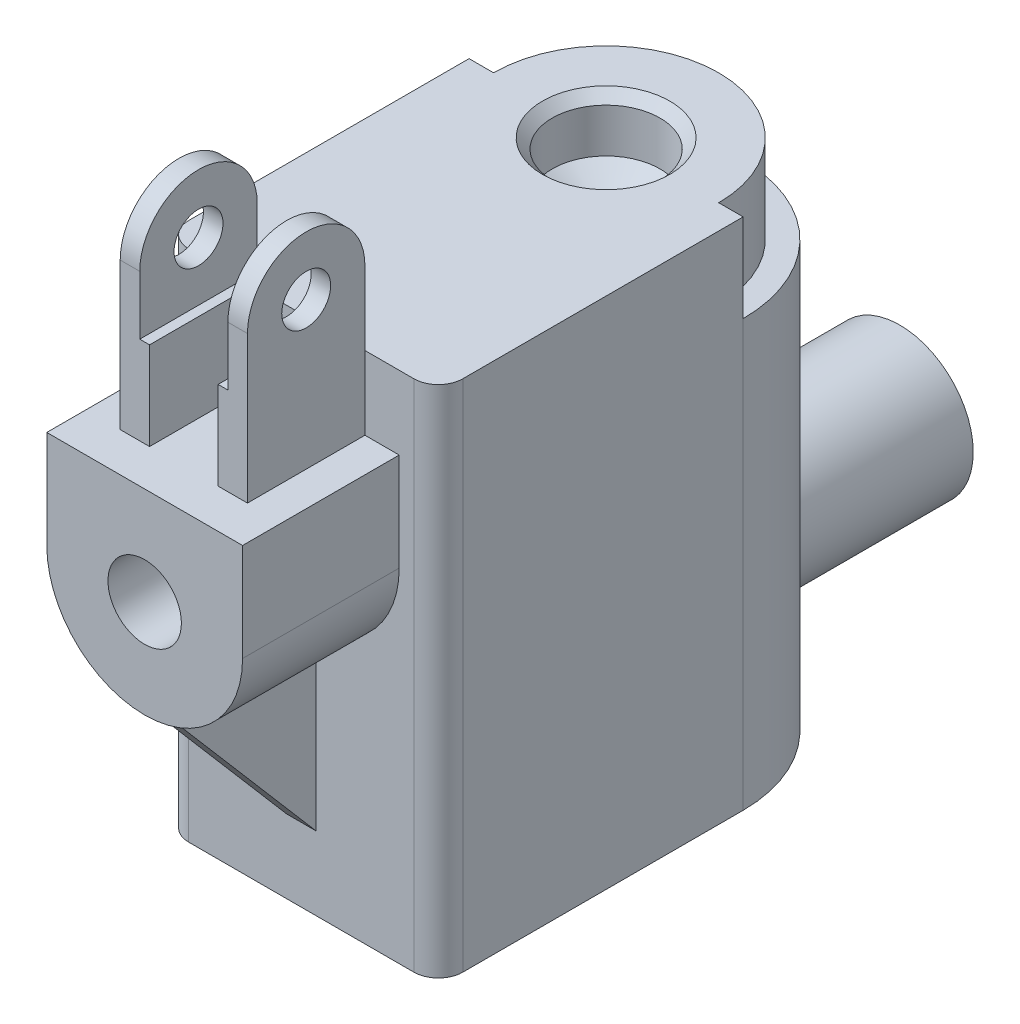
ISO-10303-21;
HEADER;
FILE_DESCRIPTION(('STEP AP214'),'2;1');
FILE_NAME('part.step','',(''),(''),'','','');
FILE_SCHEMA(('AUTOMOTIVE_DESIGN { 1 0 10303 214 1 1 1 1 }'));
ENDSEC;
DATA;
#1=APPLICATION_CONTEXT('core data for automotive mechanical design processes');
#2=APPLICATION_PROTOCOL_DEFINITION('international standard','automotive_design',2000,#1);
#3=PRODUCT_CONTEXT('',#1,'mechanical');
#4=PRODUCT('Part','Part','',(#3));
#5=PRODUCT_RELATED_PRODUCT_CATEGORY('part','',(#4));
#6=PRODUCT_DEFINITION_FORMATION('','',#4);
#7=PRODUCT_DEFINITION_CONTEXT('part definition',#1,'design');
#8=PRODUCT_DEFINITION('design','',#6,#7);
#9=PRODUCT_DEFINITION_SHAPE('','',#8);
#10=(LENGTH_UNIT() NAMED_UNIT(*) SI_UNIT(.MILLI.,.METRE.));
#11=(NAMED_UNIT(*) PLANE_ANGLE_UNIT() SI_UNIT($,.RADIAN.));
#12=(NAMED_UNIT(*) SI_UNIT($,.STERADIAN.) SOLID_ANGLE_UNIT());
#13=UNCERTAINTY_MEASURE_WITH_UNIT(LENGTH_MEASURE(1.E-05),#10,'distance_accuracy_value','');
#14=(GEOMETRIC_REPRESENTATION_CONTEXT(3) GLOBAL_UNCERTAINTY_ASSIGNED_CONTEXT((#13)) GLOBAL_UNIT_ASSIGNED_CONTEXT((#10,
#11,#12)) REPRESENTATION_CONTEXT('',''));
#15=CARTESIAN_POINT('',(0.,0.,0.));
#16=DIRECTION('',(0.,0.,1.));
#17=DIRECTION('',(1.,0.,0.));
#18=AXIS2_PLACEMENT_3D('',#15,#16,#17);
#19=CARTESIAN_POINT('',(0.,0.,0.));
#20=DIRECTION('',(0.,1.,0.));
#21=DIRECTION('',(0.,0.,1.));
#22=AXIS2_PLACEMENT_3D('',#19,#20,#21);
#23=PLANE('',#22);
#24=CARTESIAN_POINT('',(0.,0.,0.));
#25=DIRECTION('',(0.,1.,0.));
#26=DIRECTION('',(0.,0.,1.));
#27=AXIS2_PLACEMENT_3D('',#24,#25,#26);
#28=CIRCLE('',#27,18.);
#29=CARTESIAN_POINT('',(0.,0.,18.));
#30=VERTEX_POINT('',#29);
#31=EDGE_CURVE('E1129',#30,#30,#28,.T.);
#32=ORIENTED_EDGE('',*,*,#31,.T.);
#33=EDGE_LOOP('',(#32));
#34=FACE_BOUND('',#33,.T.);
#35=CARTESIAN_POINT('',(0.,0.,0.));
#36=DIRECTION('',(0.,1.,0.));
#37=DIRECTION('',(0.,0.,1.));
#38=AXIS2_PLACEMENT_3D('',#35,#36,#37);
#39=CIRCLE('',#38,28.);
#40=CARTESIAN_POINT('',(-28.,0.,0.));
#41=VERTEX_POINT('',#40);
#42=CARTESIAN_POINT('',(28.,0.,0.));
#43=VERTEX_POINT('',#42);
#44=EDGE_CURVE('E433',#41,#43,#39,.F.);
#45=ORIENTED_EDGE('',*,*,#44,.T.);
#46=DIRECTION('',(0.,0.,1.));
#47=VECTOR('',#46,1.);
#48=CARTESIAN_POINT('',(28.,0.,0.));
#49=LINE('',#48,#47);
#50=CARTESIAN_POINT('',(28.,0.,57.2758620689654));
#51=VERTEX_POINT('',#50);
#52=EDGE_CURVE('E441',#43,#51,#49,.T.);
#53=ORIENTED_EDGE('',*,*,#52,.T.);
#54=CARTESIAN_POINT('',(23.,0.,57.2758620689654));
#55=DIRECTION('',(0.,1.,0.));
#56=DIRECTION('',(0.,0.,1.));
#57=AXIS2_PLACEMENT_3D('',#54,#55,#56);
#58=CIRCLE('',#57,5.);
#59=CARTESIAN_POINT('',(23.,0.,62.2758620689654));
#60=VERTEX_POINT('',#59);
#61=EDGE_CURVE('E471',#51,#60,#58,.F.);
#62=ORIENTED_EDGE('',*,*,#61,.T.);
#63=DIRECTION('',(1.,0.,0.));
#64=VECTOR('',#63,1.);
#65=CARTESIAN_POINT('',(0.,0.,62.2758620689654));
#66=LINE('',#65,#64);
#67=CARTESIAN_POINT('',(-23.,0.,62.2758620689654));
#68=VERTEX_POINT('',#67);
#69=EDGE_CURVE('E454',#68,#60,#66,.T.);
#70=ORIENTED_EDGE('',*,*,#69,.F.);
#71=CARTESIAN_POINT('',(-23.,0.,57.2758620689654));
#72=DIRECTION('',(0.,1.,0.));
#73=DIRECTION('',(0.,0.,1.));
#74=AXIS2_PLACEMENT_3D('',#71,#72,#73);
#75=CIRCLE('',#74,5.);
#76=CARTESIAN_POINT('',(-28.,0.,57.2758620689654));
#77=VERTEX_POINT('',#76);
#78=EDGE_CURVE('E473',#68,#77,#75,.F.);
#79=ORIENTED_EDGE('',*,*,#78,.T.);
#80=DIRECTION('',(0.,0.,1.));
#81=VECTOR('',#80,1.);
#82=CARTESIAN_POINT('',(-28.,0.,0.));
#83=LINE('',#82,#81);
#84=EDGE_CURVE('E451',#41,#77,#83,.T.);
#85=ORIENTED_EDGE('',*,*,#84,.F.);
#86=EDGE_LOOP('',(#45,#53,#62,#70,#79,#85));
#87=FACE_BOUND('',#86,.T.);
#88=ADVANCED_FACE('F43',(#34,#87),#23,.F.);
#89=CARTESIAN_POINT('',(-13.,120.,74.2758620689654));
#90=DIRECTION('',(1.,0.,0.));
#91=DIRECTION('',(0.,0.,-1.));
#92=AXIS2_PLACEMENT_3D('',#89,#90,#91);
#93=CYLINDRICAL_SURFACE('',#92,12.);
#94=CARTESIAN_POINT('',(-9.,120.,74.2758620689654));
#95=DIRECTION('',(-1.,0.,0.));
#96=DIRECTION('',(0.,0.,1.));
#97=AXIS2_PLACEMENT_3D('',#94,#95,#96);
#98=CIRCLE('',#97,12.);
#99=CARTESIAN_POINT('',(-9.,120.,86.2758620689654));
#100=VERTEX_POINT('',#99);
#101=CARTESIAN_POINT('',(-9.,120.,62.2758620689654));
#102=VERTEX_POINT('',#101);
#103=EDGE_CURVE('E279',#100,#102,#98,.T.);
#104=ORIENTED_EDGE('',*,*,#103,.T.);
#105=DIRECTION('',(1.,0.,0.));
#106=VECTOR('',#105,1.);
#107=CARTESIAN_POINT('',(-13.,120.,62.2758620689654));
#108=LINE('',#107,#106);
#109=CARTESIAN_POINT('',(-13.,120.,62.2758620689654));
#110=VERTEX_POINT('',#109);
#111=EDGE_CURVE('E324',#110,#102,#108,.T.);
#112=ORIENTED_EDGE('',*,*,#111,.F.);
#113=CARTESIAN_POINT('',(-13.,120.,74.2758620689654));
#114=DIRECTION('',(1.,0.,0.));
#115=DIRECTION('',(0.,0.,-1.));
#116=AXIS2_PLACEMENT_3D('',#113,#114,#115);
#117=CIRCLE('',#116,12.);
#118=CARTESIAN_POINT('',(-13.,120.,86.2758620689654));
#119=VERTEX_POINT('',#118);
#120=EDGE_CURVE('E298',#119,#110,#117,.F.);
#121=ORIENTED_EDGE('',*,*,#120,.F.);
#122=DIRECTION('',(1.,0.,0.));
#123=VECTOR('',#122,1.);
#124=CARTESIAN_POINT('',(-13.,120.,86.2758620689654));
#125=LINE('',#124,#123);
#126=EDGE_CURVE('E311',#119,#100,#125,.T.);
#127=ORIENTED_EDGE('',*,*,#126,.T.);
#128=EDGE_LOOP('',(#104,#112,#121,#127));
#129=FACE_BOUND('',#128,.T.);
#130=ADVANCED_FACE('F547',(#129),#93,.T.);
#131=CARTESIAN_POINT('',(-13.,0.,62.2758620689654));
#132=DIRECTION('',(0.,0.,-1.));
#133=DIRECTION('',(-1.,0.,0.));
#134=AXIS2_PLACEMENT_3D('',#131,#132,#133);
#135=PLANE('',#134);
#136=DIRECTION('',(0.,-1.,0.));
#137=VECTOR('',#136,1.);
#138=CARTESIAN_POINT('',(-9.,0.,62.2758620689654));
#139=LINE('',#138,#137);
#140=CARTESIAN_POINT('',(-9.,108.,62.2758620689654));
#141=VERTEX_POINT('',#140);
#142=EDGE_CURVE('E276',#102,#141,#139,.T.);
#143=ORIENTED_EDGE('',*,*,#142,.T.);
#144=DIRECTION('',(1.,0.,0.));
#145=VECTOR('',#144,1.);
#146=CARTESIAN_POINT('',(-9.,108.,62.2758620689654));
#147=LINE('',#146,#145);
#148=CARTESIAN_POINT('',(-7.,108.,62.2758620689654));
#149=VERTEX_POINT('',#148);
#150=EDGE_CURVE('E290',#141,#149,#147,.T.);
#151=ORIENTED_EDGE('',*,*,#150,.T.);
#152=DIRECTION('',(0.,1.,0.));
#153=VECTOR('',#152,1.);
#154=CARTESIAN_POINT('',(-7.,0.,62.2758620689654));
#155=LINE('',#154,#153);
#156=CARTESIAN_POINT('',(-7.,105.,62.2758620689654));
#157=VERTEX_POINT('',#156);
#158=EDGE_CURVE('E293',#157,#149,#155,.T.);
#159=ORIENTED_EDGE('',*,*,#158,.F.);
#160=DIRECTION('',(-1.,0.,0.));
#161=VECTOR('',#160,1.);
#162=CARTESIAN_POINT('',(0.,105.,62.2758620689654));
#163=LINE('',#162,#161);
#164=CARTESIAN_POINT('',(-13.,105.,62.2758620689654));
#165=VERTEX_POINT('',#164);
#166=EDGE_CURVE('E327',#157,#165,#163,.T.);
#167=ORIENTED_EDGE('',*,*,#166,.T.);
#168=DIRECTION('',(0.,1.,0.));
#169=VECTOR('',#168,1.);
#170=CARTESIAN_POINT('',(-13.,0.,62.2758620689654));
#171=LINE('',#170,#169);
#172=EDGE_CURVE('E302',#165,#110,#171,.T.);
#173=ORIENTED_EDGE('',*,*,#172,.T.);
#174=ORIENTED_EDGE('',*,*,#111,.T.);
#175=EDGE_LOOP('',(#143,#151,#159,#167,#173,#174));
#176=FACE_BOUND('',#175,.T.);
#177=ADVANCED_FACE('F592',(#176),#135,.T.);
#178=CARTESIAN_POINT('',(-13.,120.,74.2758620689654));
#179=DIRECTION('',(1.,0.,0.));
#180=DIRECTION('',(0.,0.,-1.));
#181=AXIS2_PLACEMENT_3D('',#178,#179,#180);
#182=CYLINDRICAL_SURFACE('',#181,5.00000000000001);
#183=CARTESIAN_POINT('',(-13.,120.,74.2758620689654));
#184=DIRECTION('',(1.,0.,0.));
#185=DIRECTION('',(0.,0.,-1.));
#186=AXIS2_PLACEMENT_3D('',#183,#184,#185);
#187=CIRCLE('',#186,5.00000000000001);
#188=CARTESIAN_POINT('',(-13.,120.,69.2758620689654));
#189=VERTEX_POINT('',#188);
#190=EDGE_CURVE('E295',#189,#189,#187,.T.);
#191=ORIENTED_EDGE('',*,*,#190,.F.);
#192=EDGE_LOOP('',(#191));
#193=FACE_BOUND('',#192,.T.);
#194=CARTESIAN_POINT('',(-9.,120.,74.2758620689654));
#195=DIRECTION('',(-1.,0.,0.));
#196=DIRECTION('',(0.,0.,1.));
#197=AXIS2_PLACEMENT_3D('',#194,#195,#196);
#198=CIRCLE('',#197,5.00000000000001);
#199=CARTESIAN_POINT('',(-9.,120.,79.2758620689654));
#200=VERTEX_POINT('',#199);
#201=EDGE_CURVE('E273',#200,#200,#198,.F.);
#202=ORIENTED_EDGE('',*,*,#201,.T.);
#203=EDGE_LOOP('',(#202));
#204=FACE_BOUND('',#203,.T.);
#205=ADVANCED_FACE('F729',(#193,#204),#182,.F.);
#206=CARTESIAN_POINT('',(-13.,0.,86.2758620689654));
#207=DIRECTION('',(0.,0.,-1.));
#208=DIRECTION('',(-1.,0.,0.));
#209=AXIS2_PLACEMENT_3D('',#206,#207,#208);
#210=PLANE('',#209);
#211=DIRECTION('',(1.,0.,0.));
#212=VECTOR('',#211,1.);
#213=CARTESIAN_POINT('',(-9.,108.,86.2758620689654));
#214=LINE('',#213,#212);
#215=CARTESIAN_POINT('',(-9.,108.,86.2758620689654));
#216=VERTEX_POINT('',#215);
#217=CARTESIAN_POINT('',(-7.,108.,86.2758620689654));
#218=VERTEX_POINT('',#217);
#219=EDGE_CURVE('E287',#216,#218,#214,.T.);
#220=ORIENTED_EDGE('',*,*,#219,.F.);
#221=DIRECTION('',(0.,1.,0.));
#222=VECTOR('',#221,1.);
#223=CARTESIAN_POINT('',(-9.,0.,86.2758620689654));
#224=LINE('',#223,#222);
#225=EDGE_CURVE('E282',#216,#100,#224,.T.);
#226=ORIENTED_EDGE('',*,*,#225,.T.);
#227=ORIENTED_EDGE('',*,*,#126,.F.);
#228=DIRECTION('',(0.,1.,0.));
#229=VECTOR('',#228,1.);
#230=CARTESIAN_POINT('',(-13.,0.,86.2758620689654));
#231=LINE('',#230,#229);
#232=CARTESIAN_POINT('',(-13.,90.,86.2758620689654));
#233=VERTEX_POINT('',#232);
#234=EDGE_CURVE('E309',#233,#119,#231,.T.);
#235=ORIENTED_EDGE('',*,*,#234,.F.);
#236=DIRECTION('',(1.,0.,0.));
#237=VECTOR('',#236,1.);
#238=CARTESIAN_POINT('',(-13.,90.,86.2758620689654));
#239=LINE('',#238,#237);
#240=CARTESIAN_POINT('',(-7.,90.,86.2758620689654));
#241=VERTEX_POINT('',#240);
#242=EDGE_CURVE('E321',#233,#241,#239,.T.);
#243=ORIENTED_EDGE('',*,*,#242,.T.);
#244=DIRECTION('',(0.,1.,0.));
#245=VECTOR('',#244,1.);
#246=CARTESIAN_POINT('',(-7.,0.,86.2758620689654));
#247=LINE('',#246,#245);
#248=EDGE_CURVE('E299',#241,#218,#247,.T.);
#249=ORIENTED_EDGE('',*,*,#248,.T.);
#250=EDGE_LOOP('',(#220,#226,#227,#235,#243,#249));
#251=FACE_BOUND('',#250,.T.);
#252=ADVANCED_FACE('F586',(#251),#210,.F.);
#253=CARTESIAN_POINT('',(-7.,0.,0.));
#254=DIRECTION('',(-1.,0.,0.));
#255=DIRECTION('',(0.,0.,-1.));
#256=AXIS2_PLACEMENT_3D('',#253,#254,#255);
#257=PLANE('',#256);
#258=DIRECTION('',(0.,0.,1.));
#259=VECTOR('',#258,1.);
#260=CARTESIAN_POINT('',(-7.,108.,0.));
#261=LINE('',#260,#259);
#262=EDGE_CURVE('E272',#149,#218,#261,.T.);
#263=ORIENTED_EDGE('',*,*,#262,.T.);
#264=ORIENTED_EDGE('',*,*,#248,.F.);
#265=DIRECTION('',(0.,0.,-1.));
#266=VECTOR('',#265,1.);
#267=CARTESIAN_POINT('',(-7.,90.,0.));
#268=LINE('',#267,#266);
#269=CARTESIAN_POINT('',(-7.,90.,62.2758620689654));
#270=VERTEX_POINT('',#269);
#271=EDGE_CURVE('E315',#241,#270,#268,.T.);
#272=ORIENTED_EDGE('',*,*,#271,.T.);
#273=EDGE_CURVE('E312',#270,#157,#155,.T.);
#274=ORIENTED_EDGE('',*,*,#273,.T.);
#275=ORIENTED_EDGE('',*,*,#158,.T.);
#276=EDGE_LOOP('',(#263,#264,#272,#274,#275));
#277=FACE_BOUND('',#276,.T.);
#278=ADVANCED_FACE('F723',(#277),#257,.F.);
#279=CARTESIAN_POINT('',(0.,105.,62.2758620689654));
#280=DIRECTION('',(0.,0.,-1.));
#281=DIRECTION('',(-1.,0.,0.));
#282=AXIS2_PLACEMENT_3D('',#279,#280,#281);
#283=PLANE('',#282);
#284=DIRECTION('',(0.,1.,0.));
#285=VECTOR('',#284,1.);
#286=CARTESIAN_POINT('',(7.,0.,62.2758620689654));
#287=LINE('',#286,#285);
#288=CARTESIAN_POINT('',(7.,90.,62.2758620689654));
#289=VERTEX_POINT('',#288);
#290=CARTESIAN_POINT('',(7.,105.,62.2758620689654));
#291=VERTEX_POINT('',#290);
#292=EDGE_CURVE('E354',#289,#291,#287,.T.);
#293=ORIENTED_EDGE('',*,*,#292,.T.);
#294=DIRECTION('',(1.,0.,0.));
#295=VECTOR('',#294,1.);
#296=CARTESIAN_POINT('',(0.,105.,62.2758620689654));
#297=LINE('',#296,#295);
#298=EDGE_CURVE('E446',#157,#291,#297,.T.);
#299=ORIENTED_EDGE('',*,*,#298,.F.);
#300=ORIENTED_EDGE('',*,*,#273,.F.);
#301=DIRECTION('',(1.,0.,0.));
#302=VECTOR('',#301,1.);
#303=CARTESIAN_POINT('',(0.,90.,62.2758620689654));
#304=LINE('',#303,#302);
#305=EDGE_CURVE('E405',#270,#289,#304,.T.);
#306=ORIENTED_EDGE('',*,*,#305,.T.);
#307=EDGE_LOOP('',(#293,#299,#300,#306));
#308=FACE_BOUND('',#307,.T.);
#309=ADVANCED_FACE('F554',(#308),#283,.F.);
#310=CARTESIAN_POINT('',(13.,120.,74.2758620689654));
#311=DIRECTION('',(-1.,0.,0.));
#312=DIRECTION('',(0.,0.,1.));
#313=AXIS2_PLACEMENT_3D('',#310,#311,#312);
#314=CYLINDRICAL_SURFACE('',#313,12.);
#315=DIRECTION('',(-1.,0.,0.));
#316=VECTOR('',#315,1.);
#317=CARTESIAN_POINT('',(13.,120.,62.2758620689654));
#318=LINE('',#317,#316);
#319=CARTESIAN_POINT('',(13.,120.,62.2758620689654));
#320=VERTEX_POINT('',#319);
#321=CARTESIAN_POINT('',(9.,120.,62.2758620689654));
#322=VERTEX_POINT('',#321);
#323=EDGE_CURVE('E366',#320,#322,#318,.T.);
#324=ORIENTED_EDGE('',*,*,#323,.T.);
#325=CARTESIAN_POINT('',(9.,120.,74.2758620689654));
#326=DIRECTION('',(-1.,0.,0.));
#327=DIRECTION('',(0.,0.,1.));
#328=AXIS2_PLACEMENT_3D('',#325,#326,#327);
#329=CIRCLE('',#328,12.);
#330=CARTESIAN_POINT('',(9.,120.,86.2758620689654));
#331=VERTEX_POINT('',#330);
#332=EDGE_CURVE('E341',#331,#322,#329,.T.);
#333=ORIENTED_EDGE('',*,*,#332,.F.);
#334=DIRECTION('',(-1.,0.,0.));
#335=VECTOR('',#334,1.);
#336=CARTESIAN_POINT('',(13.,120.,86.2758620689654));
#337=LINE('',#336,#335);
#338=CARTESIAN_POINT('',(13.,120.,86.2758620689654));
#339=VERTEX_POINT('',#338);
#340=EDGE_CURVE('E380',#339,#331,#337,.T.);
#341=ORIENTED_EDGE('',*,*,#340,.F.);
#342=CARTESIAN_POINT('',(13.,120.,74.2758620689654));
#343=DIRECTION('',(1.,0.,0.));
#344=DIRECTION('',(0.,0.,-1.));
#345=AXIS2_PLACEMENT_3D('',#342,#343,#344);
#346=CIRCLE('',#345,12.);
#347=EDGE_CURVE('E353',#339,#320,#346,.F.);
#348=ORIENTED_EDGE('',*,*,#347,.T.);
#349=EDGE_LOOP('',(#324,#333,#341,#348));
#350=FACE_BOUND('',#349,.T.);
#351=ADVANCED_FACE('F756',(#350),#314,.T.);
#352=CARTESIAN_POINT('',(13.,120.,74.2758620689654));
#353=DIRECTION('',(-1.,0.,0.));
#354=DIRECTION('',(0.,0.,1.));
#355=AXIS2_PLACEMENT_3D('',#352,#353,#354);
#356=CYLINDRICAL_SURFACE('',#355,5.00000000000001);
#357=CARTESIAN_POINT('',(13.,120.,74.2758620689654));
#358=DIRECTION('',(1.,0.,0.));
#359=DIRECTION('',(0.,0.,-1.));
#360=AXIS2_PLACEMENT_3D('',#357,#358,#359);
#361=CIRCLE('',#360,5.00000000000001);
#362=CARTESIAN_POINT('',(13.,120.,69.2758620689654));
#363=VERTEX_POINT('',#362);
#364=EDGE_CURVE('E350',#363,#363,#361,.T.);
#365=ORIENTED_EDGE('',*,*,#364,.T.);
#366=EDGE_LOOP('',(#365));
#367=FACE_BOUND('',#366,.T.);
#368=CARTESIAN_POINT('',(9.,120.,74.2758620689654));
#369=DIRECTION('',(-1.,0.,0.));
#370=DIRECTION('',(0.,0.,1.));
#371=AXIS2_PLACEMENT_3D('',#368,#369,#370);
#372=CIRCLE('',#371,5.00000000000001);
#373=CARTESIAN_POINT('',(9.,120.,79.2758620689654));
#374=VERTEX_POINT('',#373);
#375=EDGE_CURVE('E330',#374,#374,#372,.F.);
#376=ORIENTED_EDGE('',*,*,#375,.F.);
#377=EDGE_LOOP('',(#376));
#378=FACE_BOUND('',#377,.T.);
#379=ADVANCED_FACE('F560',(#367,#378),#356,.F.);
#380=CARTESIAN_POINT('',(0.,105.,0.));
#381=DIRECTION('',(0.,-1.,0.));
#382=DIRECTION('',(0.,0.,-1.));
#383=AXIS2_PLACEMENT_3D('',#380,#381,#382);
#384=CYLINDRICAL_SURFACE('',#383,28.);
#385=CARTESIAN_POINT('',(15.,26.8705432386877,-23.6431808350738));
#386=CARTESIAN_POINT('',(15.0000018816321,26.4840804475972,-23.6431784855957));
#387=CARTESIAN_POINT('',(14.9850464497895,26.0976389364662,-23.6526874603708));
#388=CARTESIAN_POINT('',(14.9254516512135,25.327825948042,-23.6903384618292));
#389=CARTESIAN_POINT('',(14.8808013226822,24.9444556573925,-23.718487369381));
#390=CARTESIAN_POINT('',(14.7623745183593,24.1833752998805,-23.792375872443));
#391=CARTESIAN_POINT('',(14.6885529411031,23.8056749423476,-23.8381427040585));
#392=CARTESIAN_POINT('',(14.5127877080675,23.0592422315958,-23.9455543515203));
#393=CARTESIAN_POINT('',(14.4108458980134,22.6905092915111,-24.0071981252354));
#394=CARTESIAN_POINT('',(14.1807503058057,21.9664904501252,-24.1438208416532));
#395=CARTESIAN_POINT('',(14.0527629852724,21.611135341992,-24.218714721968));
#396=CARTESIAN_POINT('',(13.7713859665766,20.9131452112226,-24.3798113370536));
#397=CARTESIAN_POINT('',(13.6179863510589,20.5705152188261,-24.4660184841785));
#398=CARTESIAN_POINT('',(13.2870664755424,19.8996205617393,-24.6473008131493));
#399=CARTESIAN_POINT('',(13.109548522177,19.5713545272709,-24.7423751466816));
#400=CARTESIAN_POINT('',(12.7315598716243,18.9304039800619,-24.9389806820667));
#401=CARTESIAN_POINT('',(12.5310907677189,18.6177183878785,-25.040511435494));
#402=CARTESIAN_POINT('',(12.0880293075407,17.9798509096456,-25.2575941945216));
#403=CARTESIAN_POINT('',(11.8432421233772,17.6563321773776,-25.3735586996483));
#404=CARTESIAN_POINT('',(11.3286782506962,17.0305656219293,-25.6074388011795));
#405=CARTESIAN_POINT('',(11.0589002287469,16.7283189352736,-25.7253545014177));
#406=CARTESIAN_POINT('',(10.4953884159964,16.1462239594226,-25.9603557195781));
#407=CARTESIAN_POINT('',(10.2016373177,15.8663921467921,-26.0774405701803));
#408=CARTESIAN_POINT('',(9.59171912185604,15.3308916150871,-26.3078917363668));
#409=CARTESIAN_POINT('',(9.27556006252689,15.0752143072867,-26.4212593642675));
#410=CARTESIAN_POINT('',(8.59569783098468,14.5698307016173,-26.6505684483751));
#411=CARTESIAN_POINT('',(8.23021659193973,14.3222680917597,-26.7659803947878));
#412=CARTESIAN_POINT('',(7.47646405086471,13.8590808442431,-26.9862305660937));
#413=CARTESIAN_POINT('',(7.08819120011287,13.6434583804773,-27.0910680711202));
#414=CARTESIAN_POINT('',(6.29146054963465,13.2464657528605,-27.2870977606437));
#415=CARTESIAN_POINT('',(5.88301406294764,13.0650766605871,-27.3782974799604));
#416=CARTESIAN_POINT('',(5.04865937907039,12.7386062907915,-27.5443619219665));
#417=CARTESIAN_POINT('',(4.62275337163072,12.5935204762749,-27.6192286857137));
#418=CARTESIAN_POINT('',(3.79147269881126,12.3516967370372,-27.7450378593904));
#419=CARTESIAN_POINT('',(3.38716653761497,12.252027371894,-27.7974113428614));
#420=CARTESIAN_POINT('',(2.56984768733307,12.0864404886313,-27.8848477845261));
#421=CARTESIAN_POINT('',(2.1568354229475,12.0205213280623,-27.9199115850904));
#422=CARTESIAN_POINT('',(1.32585311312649,11.9234028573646,-27.9716877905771));
#423=CARTESIAN_POINT('',(0.90788617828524,11.8921828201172,-27.9884111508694));
#424=CARTESIAN_POINT('',(0.070489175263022,11.8648615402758,-28.0030416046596));
#425=CARTESIAN_POINT('',(-0.348940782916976,11.8687577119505,-28.0009500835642));
#426=CARTESIAN_POINT('',(-1.14376624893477,11.9094591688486,-27.9791673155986));
#427=CARTESIAN_POINT('',(-1.5193859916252,11.9429473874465,-27.9612501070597));
#428=CARTESIAN_POINT('',(-2.2660340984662,12.037920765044,-27.9106622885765));
#429=CARTESIAN_POINT('',(-2.63706283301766,12.0994036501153,-27.877992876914));
#430=CARTESIAN_POINT('',(-3.3720246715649,12.2496623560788,-27.7986707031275));
#431=CARTESIAN_POINT('',(-3.73595753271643,12.33843910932,-27.7520174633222));
#432=CARTESIAN_POINT('',(-4.45443109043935,12.5423366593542,-27.6457941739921));
#433=CARTESIAN_POINT('',(-4.80897142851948,12.6574584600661,-27.5862236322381));
#434=CARTESIAN_POINT('',(-5.51071811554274,12.9144244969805,-27.4547068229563));
#435=CARTESIAN_POINT('',(-5.85778942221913,13.0565667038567,-27.3826234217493));
#436=CARTESIAN_POINT('',(-6.53841722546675,13.3654044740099,-27.228126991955));
#437=CARTESIAN_POINT('',(-6.87197377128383,13.532099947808,-27.1457140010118));
#438=CARTESIAN_POINT('',(-7.52411199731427,13.8887905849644,-26.97223786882));
#439=CARTESIAN_POINT('',(-7.84269058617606,14.0787905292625,-26.8811729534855));
#440=CARTESIAN_POINT('',(-8.46352563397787,14.4808084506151,-26.6922095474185));
#441=CARTESIAN_POINT('',(-8.76578045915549,14.6928286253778,-26.5943103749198));
#442=CARTESIAN_POINT('',(-9.3834291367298,15.1608623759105,-26.383111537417));
#443=CARTESIAN_POINT('',(-9.69691060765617,15.419158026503,-26.2692700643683));
#444=CARTESIAN_POINT('',(-10.3012541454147,15.9596073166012,-26.0382189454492));
#445=CARTESIAN_POINT('',(-10.5921148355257,16.2417624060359,-25.9210090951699));
#446=CARTESIAN_POINT('',(-11.1501578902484,16.8287271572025,-25.6859049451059));
#447=CARTESIAN_POINT('',(-11.4173239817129,17.133552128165,-25.5680102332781));
#448=CARTESIAN_POINT('',(-11.9266268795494,17.7644996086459,-25.3344450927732));
#449=CARTESIAN_POINT('',(-12.1687515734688,18.0906323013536,-25.2187757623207));
#450=CARTESIAN_POINT('',(-12.6450039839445,18.789890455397,-24.9835942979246));
#451=CARTESIAN_POINT('',(-12.8769092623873,19.1646842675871,-24.8645254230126));
#452=CARTESIAN_POINT('',(-13.3078501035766,19.9354194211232,-24.6365692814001));
#453=CARTESIAN_POINT('',(-13.5069029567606,20.3313494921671,-24.5276766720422));
#454=CARTESIAN_POINT('',(-13.8701973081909,21.1421218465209,-24.324082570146));
#455=CARTESIAN_POINT('',(-14.0344600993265,21.5569523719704,-24.2293724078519));
#456=CARTESIAN_POINT('',(-14.3262287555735,22.402962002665,-24.0580102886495));
#457=CARTESIAN_POINT('',(-14.4537403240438,22.8341385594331,-23.981355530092));
#458=CARTESIAN_POINT('',(-14.6612680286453,23.6738557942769,-23.8549945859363));
#459=CARTESIAN_POINT('',(-14.7442961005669,24.0813985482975,-23.8036077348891));
#460=CARTESIAN_POINT('',(-14.8763649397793,24.9040134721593,-23.7212956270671));
#461=CARTESIAN_POINT('',(-14.9254078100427,25.3190851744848,-23.6903691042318));
#462=CARTESIAN_POINT('',(-14.9886310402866,26.1525785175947,-23.6504196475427));
#463=CARTESIAN_POINT('',(-15.00284095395,26.5709970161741,-23.641378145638));
#464=CARTESIAN_POINT('',(-14.9962202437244,27.4074231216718,-23.6455791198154));
#465=CARTESIAN_POINT('',(-14.9753929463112,27.8254307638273,-23.6588194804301));
#466=CARTESIAN_POINT('',(-14.9042375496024,28.6009517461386,-23.7036946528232));
#467=CARTESIAN_POINT('',(-14.8582580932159,28.959033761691,-23.7326133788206));
#468=CARTESIAN_POINT('',(-14.7409612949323,29.6694049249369,-23.805647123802));
#469=CARTESIAN_POINT('',(-14.6696467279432,30.021694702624,-23.8497604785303));
#470=CARTESIAN_POINT('',(-14.5024820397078,30.7184562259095,-23.9517761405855));
#471=CARTESIAN_POINT('',(-14.406624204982,31.0629254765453,-24.0096827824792));
#472=CARTESIAN_POINT('',(-14.1913572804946,31.7421256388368,-24.1375440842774));
#473=CARTESIAN_POINT('',(-14.0719466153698,32.0768558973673,-24.2074995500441));
#474=CARTESIAN_POINT('',(-13.8048914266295,32.7494523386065,-24.3608228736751));
#475=CARTESIAN_POINT('',(-13.6562400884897,33.0868148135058,-24.4446436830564));
#476=CARTESIAN_POINT('',(-13.3355250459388,33.7479577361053,-24.6210736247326));
#477=CARTESIAN_POINT('',(-13.1634529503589,34.0717332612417,-24.7136859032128));
#478=CARTESIAN_POINT('',(-12.7969902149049,34.7044917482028,-24.9054171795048));
#479=CARTESIAN_POINT('',(-12.6025934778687,35.0134706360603,-25.004537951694));
#480=CARTESIAN_POINT('',(-12.1925625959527,35.615488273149,-25.2070168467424));
#481=CARTESIAN_POINT('',(-11.9769293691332,35.9085277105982,-25.3103747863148));
#482=CARTESIAN_POINT('',(-11.4917030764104,36.5201540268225,-25.53472976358));
#483=CARTESIAN_POINT('',(-11.2188568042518,36.8360444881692,-25.6560609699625));
#484=CARTESIAN_POINT('',(-10.6477191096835,37.4440988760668,-25.898307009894));
#485=CARTESIAN_POINT('',(-10.3494265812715,37.7362617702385,-26.0192218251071));
#486=CARTESIAN_POINT('',(-9.72851822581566,38.2955432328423,-26.2576959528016));
#487=CARTESIAN_POINT('',(-9.40588456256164,38.5626431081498,-26.3752527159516));
#488=CARTESIAN_POINT('',(-8.73808940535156,39.0697850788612,-26.6039527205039));
#489=CARTESIAN_POINT('',(-8.39293744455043,39.309838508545,-26.7150986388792));
#490=CARTESIAN_POINT('',(-7.66626005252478,39.7709895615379,-26.9328503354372));
#491=CARTESIAN_POINT('',(-7.28380756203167,39.990821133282,-27.0390528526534));
#492=CARTESIAN_POINT('',(-6.49828081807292,40.3971045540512,-27.2385119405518));
#493=CARTESIAN_POINT('',(-6.09520558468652,40.5835548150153,-27.3317678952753));
#494=CARTESIAN_POINT('',(-5.2715315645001,40.9207679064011,-27.5025032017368));
#495=CARTESIAN_POINT('',(-4.850947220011,41.0715594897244,-27.5799952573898));
#496=CARTESIAN_POINT('',(-3.99530056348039,41.3356027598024,-27.7168753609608));
#497=CARTESIAN_POINT('',(-3.56024028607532,41.4488596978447,-27.7762659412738));
#498=CARTESIAN_POINT('',(-2.72330882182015,41.6268309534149,-27.8701080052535));
#499=CARTESIAN_POINT('',(-2.32243436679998,41.695250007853,-27.9064509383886));
#500=CARTESIAN_POINT('',(-1.51527758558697,41.7993567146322,-27.9618940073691));
#501=CARTESIAN_POINT('',(-1.10899562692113,41.8350465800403,-27.9809953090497));
#502=CARTESIAN_POINT('',(-0.294590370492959,41.8731876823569,-28.001412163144));
#503=CARTESIAN_POINT('',(0.113532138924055,41.8756520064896,-28.0027347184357));
#504=CARTESIAN_POINT('',(0.928280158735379,41.8473394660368,-27.9875736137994));
#505=CARTESIAN_POINT('',(1.33490573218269,41.8165640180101,-27.9710907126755));
#506=CARTESIAN_POINT('',(2.10988751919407,41.726108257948,-27.9228669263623));
#507=CARTESIAN_POINT('',(2.47863570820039,41.6690192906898,-27.8924955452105));
#508=CARTESIAN_POINT('',(3.20947711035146,41.5278878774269,-27.8178748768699));
#509=CARTESIAN_POINT('',(3.57157078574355,41.4438473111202,-27.7736265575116));
#510=CARTESIAN_POINT('',(4.28686076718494,41.2497011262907,-27.6722484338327));
#511=CARTESIAN_POINT('',(4.64005651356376,41.1395938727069,-27.615117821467));
#512=CARTESIAN_POINT('',(5.33552303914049,40.8943859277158,-27.4892178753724));
#513=CARTESIAN_POINT('',(5.67779329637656,40.759284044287,-27.4204479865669));
#514=CARTESIAN_POINT('',(6.36214536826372,40.4597947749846,-27.2699537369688));
#515=CARTESIAN_POINT('',(6.70374693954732,40.2945052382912,-27.1878427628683));
#516=CARTESIAN_POINT('',(7.37164127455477,39.9396642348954,-27.0144030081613));
#517=CARTESIAN_POINT('',(7.69793382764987,39.7501124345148,-26.9230741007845));
#518=CARTESIAN_POINT('',(8.33390828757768,39.3480251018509,-26.7330535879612));
#519=CARTESIAN_POINT('',(8.64358524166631,39.1354827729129,-26.6343598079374));
#520=CARTESIAN_POINT('',(9.24505132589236,38.6887239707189,-26.4316055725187));
#521=CARTESIAN_POINT('',(9.53683861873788,38.45450527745,-26.3275445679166));
#522=CARTESIAN_POINT('',(10.1328181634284,37.9384314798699,-26.1043705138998));
#523=CARTESIAN_POINT('',(10.4347890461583,37.6541748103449,-25.9848693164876));
#524=CARTESIAN_POINT('',(11.0139824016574,37.0619016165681,-25.7447179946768));
#525=CARTESIAN_POINT('',(11.2912030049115,36.7538833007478,-25.6240677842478));
#526=CARTESIAN_POINT('',(11.8198599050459,36.11516102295,-25.3845468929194));
#527=CARTESIAN_POINT('',(12.0712666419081,35.7844317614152,-25.2656783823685));
#528=CARTESIAN_POINT('',(12.5465228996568,35.1020458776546,-25.0330734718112));
#529=CARTESIAN_POINT('',(12.7703739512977,34.7503904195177,-24.9193367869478));
#530=CARTESIAN_POINT('',(13.2007230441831,34.0074421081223,-24.694192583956));
#531=CARTESIAN_POINT('',(13.4055536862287,33.615032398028,-24.5832699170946));
#532=CARTESIAN_POINT('',(13.7808937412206,32.8105752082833,-24.3748456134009));
#533=CARTESIAN_POINT('',(13.9513973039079,32.3985243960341,-24.2773462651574));
#534=CARTESIAN_POINT('',(14.2555348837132,31.5586757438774,-24.1000139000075));
#535=CARTESIAN_POINT('',(14.3892722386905,31.1309259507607,-24.0201314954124));
#536=CARTESIAN_POINT('',(14.6184241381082,30.2621897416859,-23.8813669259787));
#537=CARTESIAN_POINT('',(14.7138639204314,29.8212122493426,-23.8224709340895));
#538=CARTESIAN_POINT('',(14.859150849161,28.963478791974,-23.7320960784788));
#539=CARTESIAN_POINT('',(14.9118857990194,28.5473937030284,-23.6988891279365));
#540=CARTESIAN_POINT('',(14.9823099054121,27.7110451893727,-23.6544324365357));
#541=CARTESIAN_POINT('',(14.9999979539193,27.2907816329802,-23.6431833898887));
#542=CARTESIAN_POINT('',(15.,26.8705432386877,-23.6431808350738));
#543=B_SPLINE_CURVE_WITH_KNOTS('',3,(#385,#386,#387,#388,#389,#390,#391,#392,#393,#394,#395,
#396,#397,#398,#399,#400,#401,#402,#403,#404,#405,#406,#407,#408,#409,#410,#411,#412,#413,#414,
#415,#416,#417,#418,#419,#420,#421,#422,#423,#424,#425,#426,#427,#428,#429,#430,#431,#432,#433,
#434,#435,#436,#437,#438,#439,#440,#441,#442,#443,#444,#445,#446,#447,#448,#449,#450,#451,#452,
#453,#454,#455,#456,#457,#458,#459,#460,#461,#462,#463,#464,#465,#466,#467,#468,#469,#470,#471,
#472,#473,#474,#475,#476,#477,#478,#479,#480,#481,#482,#483,#484,#485,#486,#487,#488,#489,#490,
#491,#492,#493,#494,#495,#496,#497,#498,#499,#500,#501,#502,#503,#504,#505,#506,#507,#508,#509,
#510,#511,#512,#513,#514,#515,#516,#517,#518,#519,#520,#521,#522,#523,#524,#525,#526,#527,#528,
#529,#530,#531,#532,#533,#534,#535,#536,#537,#538,#539,#540,#541,#542),.UNSPECIFIED.,.T.,.F.,(4,
2,2,2,2,2,2,2,2,2,2,2,2,2,2,2,2,2,2,2,2,2,2,2,2,2,2,2,2,2,2,2,2,2,2,2,2,2,2,2,2,2,2,2,2,2,2,2,2,
2,2,2,2,2,2,2,2,2,2,2,2,2,2,2,2,2,2,2,2,2,2,2,2,2,2,2,2,2,4),(0.,1.15895036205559,
2.31832878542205,3.47950677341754,4.6406085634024,5.79451030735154,6.94886343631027,
8.1031062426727,9.25726896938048,10.5217709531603,11.7863404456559,13.0518311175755,
14.3168701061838,15.6839101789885,17.0510432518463,18.4174181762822,19.7836222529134,
21.0409554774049,22.2982275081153,23.5547481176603,24.811176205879,25.942439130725,
27.0736101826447,28.204819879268,29.3360726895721,30.4806118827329,31.6251469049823,
32.7699171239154,33.9148017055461,35.1789762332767,36.4432276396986,37.7083407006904,
38.9740628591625,40.3419354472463,41.7090858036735,43.0753969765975,44.4414959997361,
45.6968692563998,46.9521648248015,48.2063949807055,49.4605060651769,50.5457958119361,
51.6309667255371,52.716479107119,53.8020641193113,54.9351521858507,56.0686472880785,
57.2024527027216,58.3362091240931,59.6388441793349,60.9415358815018,62.2451915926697,
63.5482989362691,64.907673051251,66.2671118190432,67.6254506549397,68.9835993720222,
70.2068201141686,71.429958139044,72.6526143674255,73.8752184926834,74.9970575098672,
76.1188183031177,77.2406494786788,78.362534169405,79.5261348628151,80.6897515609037,
81.8537132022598,83.0177941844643,84.3111594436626,85.6046223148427,86.8995502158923,
88.1944061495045,89.5615795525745,90.9289857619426,92.2925084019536,93.6551310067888,
94.9153300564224,96.1755689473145),.UNSPECIFIED.);
#544=CARTESIAN_POINT('',(15.,26.8705432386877,-23.6431808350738));
#545=VERTEX_POINT('',#544);
#546=EDGE_CURVE('E484',#545,#545,#543,.T.);
#547=ORIENTED_EDGE('',*,*,#546,.F.);
#548=EDGE_LOOP('',(#547));
#549=FACE_BOUND('',#548,.T.);
#550=DIRECTION('',(0.,-1.,0.));
#551=VECTOR('',#550,1.);
#552=CARTESIAN_POINT('',(-28.,105.,0.));
#553=LINE('',#552,#551);
#554=CARTESIAN_POINT('',(-28.,87.,0.));
#555=VERTEX_POINT('',#554);
#556=EDGE_CURVE('E461',#555,#41,#553,.T.);
#557=ORIENTED_EDGE('',*,*,#556,.F.);
#558=CARTESIAN_POINT('',(0.,87.,0.));
#559=DIRECTION('',(0.,1.,0.));
#560=DIRECTION('',(0.,0.,1.));
#561=AXIS2_PLACEMENT_3D('',#558,#559,#560);
#562=CIRCLE('',#561,28.);
#563=CARTESIAN_POINT('',(28.,87.,0.));
#564=VERTEX_POINT('',#563);
#565=EDGE_CURVE('E424',#564,#555,#562,.T.);
#566=ORIENTED_EDGE('',*,*,#565,.F.);
#567=DIRECTION('',(0.,-1.,0.));
#568=VECTOR('',#567,1.);
#569=CARTESIAN_POINT('',(28.,105.,0.));
#570=LINE('',#569,#568);
#571=EDGE_CURVE('E449',#564,#43,#570,.T.);
#572=ORIENTED_EDGE('',*,*,#571,.T.);
#573=ORIENTED_EDGE('',*,*,#44,.F.);
#574=EDGE_LOOP('',(#557,#566,#572,#573));
#575=FACE_BOUND('',#574,.T.);
#576=ADVANCED_FACE('F495',(#549,#575),#384,.T.);
#577=CARTESIAN_POINT('',(-28.,105.,0.));
#578=DIRECTION('',(1.,0.,0.));
#579=DIRECTION('',(0.,0.,-1.));
#580=AXIS2_PLACEMENT_3D('',#577,#578,#579);
#581=PLANE('',#580);
#582=ORIENTED_EDGE('',*,*,#84,.T.);
#583=DIRECTION('',(0.,-1.,0.));
#584=VECTOR('',#583,1.);
#585=CARTESIAN_POINT('',(-28.,105.,57.2758620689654));
#586=LINE('',#585,#584);
#587=CARTESIAN_POINT('',(-28.,105.,57.2758620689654));
#588=VERTEX_POINT('',#587);
#589=EDGE_CURVE('E475',#77,#588,#586,.F.);
#590=ORIENTED_EDGE('',*,*,#589,.T.);
#591=DIRECTION('',(0.,0.,1.));
#592=VECTOR('',#591,1.);
#593=CARTESIAN_POINT('',(-28.,105.,0.));
#594=LINE('',#593,#592);
#595=CARTESIAN_POINT('',(-28.,105.,0.));
#596=VERTEX_POINT('',#595);
#597=EDGE_CURVE('E437',#596,#588,#594,.T.);
#598=ORIENTED_EDGE('',*,*,#597,.F.);
#599=EDGE_CURVE('E462',#596,#555,#553,.T.);
#600=ORIENTED_EDGE('',*,*,#599,.T.);
#601=ORIENTED_EDGE('',*,*,#556,.T.);
#602=EDGE_LOOP('',(#582,#590,#598,#600,#601));
#603=FACE_BOUND('',#602,.T.);
#604=ADVANCED_FACE('F553',(#603),#581,.F.);
#605=CARTESIAN_POINT('',(0.,70.,62.2758620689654));
#606=DIRECTION('',(0.,0.,1.));
#607=DIRECTION('',(1.,0.,0.));
#608=AXIS2_PLACEMENT_3D('',#605,#606,#607);
#609=CIRCLE('',#608,20.);
#610=CARTESIAN_POINT('',(3.,50.2262800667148,62.2758620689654));
#611=VERTEX_POINT('',#610);
#612=CARTESIAN_POINT('',(20.,70.,62.2758620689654));
#613=VERTEX_POINT('',#612);
#614=EDGE_CURVE('E250',#611,#613,#609,.T.);
#615=ORIENTED_EDGE('',*,*,#614,.F.);
#616=DIRECTION('',(0.,-1.,0.));
#617=VECTOR('',#616,1.);
#618=CARTESIAN_POINT('',(3.,105.,62.2758620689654));
#619=LINE('',#618,#617);
#620=CARTESIAN_POINT('',(3.,15.,62.2758620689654));
#621=VERTEX_POINT('',#620);
#622=EDGE_CURVE('E59',#611,#621,#619,.T.);
#623=ORIENTED_EDGE('',*,*,#622,.T.);
#624=DIRECTION('',(-1.,0.,0.));
#625=VECTOR('',#624,1.);
#626=CARTESIAN_POINT('',(0.,15.,62.2758620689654));
#627=LINE('',#626,#625);
#628=CARTESIAN_POINT('',(-3.,15.,62.2758620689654));
#629=VERTEX_POINT('',#628);
#630=EDGE_CURVE('E63',#621,#629,#627,.T.);
#631=ORIENTED_EDGE('',*,*,#630,.T.);
#632=DIRECTION('',(0.,-1.,0.));
#633=VECTOR('',#632,1.);
#634=CARTESIAN_POINT('',(-3.,105.,62.2758620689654));
#635=LINE('',#634,#633);
#636=CARTESIAN_POINT('',(-3.,50.2262800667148,62.2758620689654));
#637=VERTEX_POINT('',#636);
#638=EDGE_CURVE('E252',#637,#629,#635,.T.);
#639=ORIENTED_EDGE('',*,*,#638,.F.);
#640=CARTESIAN_POINT('',(-20.,70.,62.2758620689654));
#641=VERTEX_POINT('',#640);
#642=EDGE_CURVE('E240',#641,#637,#609,.T.);
#643=ORIENTED_EDGE('',*,*,#642,.F.);
#644=DIRECTION('',(0.,1.,0.));
#645=VECTOR('',#644,1.);
#646=CARTESIAN_POINT('',(-20.,0.,62.2758620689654));
#647=LINE('',#646,#645);
#648=CARTESIAN_POINT('',(-20.,90.,62.2758620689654));
#649=VERTEX_POINT('',#648);
#650=EDGE_CURVE('E404',#641,#649,#647,.T.);
#651=ORIENTED_EDGE('',*,*,#650,.T.);
#652=CARTESIAN_POINT('',(-13.,90.,62.2758620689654));
#653=VERTEX_POINT('',#652);
#654=EDGE_CURVE('E401',#649,#653,#304,.T.);
#655=ORIENTED_EDGE('',*,*,#654,.T.);
#656=EDGE_CURVE('E303',#653,#165,#171,.T.);
#657=ORIENTED_EDGE('',*,*,#656,.T.);
#658=CARTESIAN_POINT('',(-23.,105.,62.2758620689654));
#659=VERTEX_POINT('',#658);
#660=EDGE_CURVE('E442',#659,#165,#297,.T.);
#661=ORIENTED_EDGE('',*,*,#660,.F.);
#662=DIRECTION('',(0.,-1.,0.));
#663=VECTOR('',#662,1.);
#664=CARTESIAN_POINT('',(-23.,105.,62.2758620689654));
#665=LINE('',#664,#663);
#666=EDGE_CURVE('E468',#659,#68,#665,.T.);
#667=ORIENTED_EDGE('',*,*,#666,.T.);
#668=ORIENTED_EDGE('',*,*,#69,.T.);
#669=DIRECTION('',(0.,-1.,0.));
#670=VECTOR('',#669,1.);
#671=CARTESIAN_POINT('',(23.,105.,62.2758620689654));
#672=LINE('',#671,#670);
#673=CARTESIAN_POINT('',(23.,105.,62.2758620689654));
#674=VERTEX_POINT('',#673);
#675=EDGE_CURVE('E465',#60,#674,#672,.F.);
#676=ORIENTED_EDGE('',*,*,#675,.T.);
#677=CARTESIAN_POINT('',(13.,105.,62.2758620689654));
#678=VERTEX_POINT('',#677);
#679=EDGE_CURVE('E440',#678,#674,#297,.T.);
#680=ORIENTED_EDGE('',*,*,#679,.F.);
#681=DIRECTION('',(0.,1.,0.));
#682=VECTOR('',#681,1.);
#683=CARTESIAN_POINT('',(13.,0.,62.2758620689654));
#684=LINE('',#683,#682);
#685=CARTESIAN_POINT('',(13.,90.,62.2758620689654));
#686=VERTEX_POINT('',#685);
#687=EDGE_CURVE('E363',#686,#678,#684,.T.);
#688=ORIENTED_EDGE('',*,*,#687,.F.);
#689=CARTESIAN_POINT('',(20.,90.,62.2758620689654));
#690=VERTEX_POINT('',#689);
#691=EDGE_CURVE('E389',#686,#690,#304,.T.);
#692=ORIENTED_EDGE('',*,*,#691,.T.);
#693=DIRECTION('',(0.,-1.,0.));
#694=VECTOR('',#693,1.);
#695=CARTESIAN_POINT('',(20.,0.,62.2758620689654));
#696=LINE('',#695,#694);
#697=EDGE_CURVE('E249',#690,#613,#696,.T.);
#698=ORIENTED_EDGE('',*,*,#697,.T.);
#699=EDGE_LOOP('',(#615,#623,#631,#639,#643,#651,#655,#657,#661,#667,#668,#676,#680,#688,#692,#698));
#700=FACE_BOUND('',#699,.T.);
#701=ADVANCED_FACE('F253',(#700),#283,.F.);
#702=CARTESIAN_POINT('',(28.,105.,0.));
#703=DIRECTION('',(1.,0.,0.));
#704=DIRECTION('',(0.,0.,-1.));
#705=AXIS2_PLACEMENT_3D('',#702,#703,#704);
#706=PLANE('',#705);
#707=DIRECTION('',(0.,0.,1.));
#708=VECTOR('',#707,1.);
#709=CARTESIAN_POINT('',(28.,105.,0.));
#710=LINE('',#709,#708);
#711=CARTESIAN_POINT('',(28.,105.,0.));
#712=VERTEX_POINT('',#711);
#713=CARTESIAN_POINT('',(28.,105.,57.2758620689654));
#714=VERTEX_POINT('',#713);
#715=EDGE_CURVE('E445',#712,#714,#710,.T.);
#716=ORIENTED_EDGE('',*,*,#715,.T.);
#717=DIRECTION('',(0.,-1.,0.));
#718=VECTOR('',#717,1.);
#719=CARTESIAN_POINT('',(28.,0.,57.2758620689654));
#720=LINE('',#719,#718);
#721=EDGE_CURVE('E481',#714,#51,#720,.T.);
#722=ORIENTED_EDGE('',*,*,#721,.T.);
#723=ORIENTED_EDGE('',*,*,#52,.F.);
#724=ORIENTED_EDGE('',*,*,#571,.F.);
#725=EDGE_CURVE('E459',#712,#564,#570,.T.);
#726=ORIENTED_EDGE('',*,*,#725,.F.);
#727=EDGE_LOOP('',(#716,#722,#723,#724,#726));
#728=FACE_BOUND('',#727,.T.);
#729=ADVANCED_FACE('F543',(#728),#706,.T.);
#730=CARTESIAN_POINT('',(0.,105.,0.));
#731=DIRECTION('',(0.,1.,0.));
#732=DIRECTION('',(0.,0.,1.));
#733=AXIS2_PLACEMENT_3D('',#730,#731,#732);
#734=PLANE('',#733);
#735=CARTESIAN_POINT('',(0.,105.,0.));
#736=DIRECTION('',(0.,1.,0.));
#737=DIRECTION('',(0.,0.,1.));
#738=AXIS2_PLACEMENT_3D('',#735,#736,#737);
#739=CIRCLE('',#738,13.0000000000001);
#740=CARTESIAN_POINT('',(0.,105.,13.0000000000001));
#741=VERTEX_POINT('',#740);
#742=EDGE_CURVE('E11',#741,#741,#739,.F.);
#743=ORIENTED_EDGE('',*,*,#742,.T.);
#744=EDGE_LOOP('',(#743));
#745=FACE_BOUND('',#744,.T.);
#746=CARTESIAN_POINT('',(0.,105.,0.));
#747=DIRECTION('',(0.,1.,0.));
#748=DIRECTION('',(0.,0.,1.));
#749=AXIS2_PLACEMENT_3D('',#746,#747,#748);
#750=CIRCLE('',#749,23.);
#751=CARTESIAN_POINT('',(23.,105.,0.));
#752=VERTEX_POINT('',#751);
#753=CARTESIAN_POINT('',(-23.,105.,0.));
#754=VERTEX_POINT('',#753);
#755=EDGE_CURVE('E417',#752,#754,#750,.T.);
#756=ORIENTED_EDGE('',*,*,#755,.T.);
#757=DIRECTION('',(1.,0.,0.));
#758=VECTOR('',#757,1.);
#759=CARTESIAN_POINT('',(0.,105.,0.));
#760=LINE('',#759,#758);
#761=EDGE_CURVE('E421',#596,#754,#760,.T.);
#762=ORIENTED_EDGE('',*,*,#761,.F.);
#763=ORIENTED_EDGE('',*,*,#597,.T.);
#764=CARTESIAN_POINT('',(-23.,105.,57.2758620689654));
#765=DIRECTION('',(0.,1.,0.));
#766=DIRECTION('',(0.,0.,1.));
#767=AXIS2_PLACEMENT_3D('',#764,#765,#766);
#768=CIRCLE('',#767,5.);
#769=EDGE_CURVE('E479',#588,#659,#768,.T.);
#770=ORIENTED_EDGE('',*,*,#769,.T.);
#771=ORIENTED_EDGE('',*,*,#660,.T.);
#772=ORIENTED_EDGE('',*,*,#166,.F.);
#773=ORIENTED_EDGE('',*,*,#298,.T.);
#774=DIRECTION('',(1.,0.,0.));
#775=VECTOR('',#774,1.);
#776=CARTESIAN_POINT('',(0.,105.,62.2758620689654));
#777=LINE('',#776,#775);
#778=EDGE_CURVE('E383',#291,#678,#777,.T.);
#779=ORIENTED_EDGE('',*,*,#778,.T.);
#780=ORIENTED_EDGE('',*,*,#679,.T.);
#781=CARTESIAN_POINT('',(23.,105.,57.2758620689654));
#782=DIRECTION('',(0.,1.,0.));
#783=DIRECTION('',(0.,0.,1.));
#784=AXIS2_PLACEMENT_3D('',#781,#782,#783);
#785=CIRCLE('',#784,5.);
#786=EDGE_CURVE('E477',#674,#714,#785,.T.);
#787=ORIENTED_EDGE('',*,*,#786,.T.);
#788=ORIENTED_EDGE('',*,*,#715,.F.);
#789=EDGE_CURVE('E428',#752,#712,#760,.T.);
#790=ORIENTED_EDGE('',*,*,#789,.F.);
#791=EDGE_LOOP('',(#756,#762,#763,#770,#771,#772,#773,#779,#780,#787,#788,#790));
#792=FACE_BOUND('',#791,.T.);
#793=ADVANCED_FACE('F539',(#745,#792),#734,.T.);
#794=CARTESIAN_POINT('',(-23.,105.,57.2758620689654));
#795=DIRECTION('',(0.,-1.,0.));
#796=DIRECTION('',(0.,0.,-1.));
#797=AXIS2_PLACEMENT_3D('',#794,#795,#796);
#798=CYLINDRICAL_SURFACE('',#797,5.);
#799=ORIENTED_EDGE('',*,*,#769,.F.);
#800=ORIENTED_EDGE('',*,*,#589,.F.);
#801=ORIENTED_EDGE('',*,*,#78,.F.);
#802=ORIENTED_EDGE('',*,*,#666,.F.);
#803=EDGE_LOOP('',(#799,#800,#801,#802));
#804=FACE_BOUND('',#803,.T.);
#805=ADVANCED_FACE('F542',(#804),#798,.T.);
#806=CARTESIAN_POINT('',(23.,105.,57.2758620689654));
#807=DIRECTION('',(0.,1.,0.));
#808=DIRECTION('',(0.,0.,1.));
#809=AXIS2_PLACEMENT_3D('',#806,#807,#808);
#810=CYLINDRICAL_SURFACE('',#809,5.);
#811=ORIENTED_EDGE('',*,*,#786,.F.);
#812=ORIENTED_EDGE('',*,*,#675,.F.);
#813=ORIENTED_EDGE('',*,*,#61,.F.);
#814=ORIENTED_EDGE('',*,*,#721,.F.);
#815=EDGE_LOOP('',(#811,#812,#813,#814));
#816=FACE_BOUND('',#815,.T.);
#817=ADVANCED_FACE('F537',(#816),#810,.T.);
#818=CARTESIAN_POINT('',(0.,87.,0.));
#819=DIRECTION('',(0.,1.,0.));
#820=DIRECTION('',(0.,0.,1.));
#821=AXIS2_PLACEMENT_3D('',#818,#819,#820);
#822=CYLINDRICAL_SURFACE('',#821,23.);
#823=CARTESIAN_POINT('',(0.,87.,0.));
#824=DIRECTION('',(0.,1.,0.));
#825=DIRECTION('',(0.,0.,1.));
#826=AXIS2_PLACEMENT_3D('',#823,#824,#825);
#827=CIRCLE('',#826,23.);
#828=CARTESIAN_POINT('',(23.,87.,0.));
#829=VERTEX_POINT('',#828);
#830=CARTESIAN_POINT('',(-23.,87.,0.));
#831=VERTEX_POINT('',#830);
#832=EDGE_CURVE('E418',#829,#831,#827,.T.);
#833=ORIENTED_EDGE('',*,*,#832,.T.);
#834=DIRECTION('',(0.,1.,0.));
#835=VECTOR('',#834,1.);
#836=CARTESIAN_POINT('',(-23.,87.,0.));
#837=LINE('',#836,#835);
#838=EDGE_CURVE('E430',#831,#754,#837,.T.);
#839=ORIENTED_EDGE('',*,*,#838,.T.);
#840=ORIENTED_EDGE('',*,*,#755,.F.);
#841=DIRECTION('',(0.,1.,0.));
#842=VECTOR('',#841,1.);
#843=CARTESIAN_POINT('',(23.,87.,0.));
#844=LINE('',#843,#842);
#845=EDGE_CURVE('E434',#829,#752,#844,.T.);
#846=ORIENTED_EDGE('',*,*,#845,.F.);
#847=EDGE_LOOP('',(#833,#839,#840,#846));
#848=FACE_BOUND('',#847,.T.);
#849=ADVANCED_FACE('F533',(#848),#822,.T.);
#850=CARTESIAN_POINT('',(0.,87.,0.));
#851=DIRECTION('',(0.,0.,1.));
#852=DIRECTION('',(1.,0.,0.));
#853=AXIS2_PLACEMENT_3D('',#850,#851,#852);
#854=PLANE('',#853);
#855=ORIENTED_EDGE('',*,*,#761,.T.);
#856=ORIENTED_EDGE('',*,*,#838,.F.);
#857=DIRECTION('',(1.,0.,0.));
#858=VECTOR('',#857,1.);
#859=CARTESIAN_POINT('',(0.,87.,0.));
#860=LINE('',#859,#858);
#861=EDGE_CURVE('E425',#555,#831,#860,.T.);
#862=ORIENTED_EDGE('',*,*,#861,.F.);
#863=ORIENTED_EDGE('',*,*,#599,.F.);
#864=EDGE_LOOP('',(#855,#856,#862,#863));
#865=FACE_BOUND('',#864,.T.);
#866=ADVANCED_FACE('F530',(#865),#854,.F.);
#867=ORIENTED_EDGE('',*,*,#789,.T.);
#868=ORIENTED_EDGE('',*,*,#725,.T.);
#869=EDGE_CURVE('E420',#829,#564,#860,.T.);
#870=ORIENTED_EDGE('',*,*,#869,.F.);
#871=ORIENTED_EDGE('',*,*,#845,.T.);
#872=EDGE_LOOP('',(#867,#868,#870,#871));
#873=FACE_BOUND('',#872,.T.);
#874=ADVANCED_FACE('F528',(#873),#854,.F.);
#875=CARTESIAN_POINT('',(0.,87.,0.));
#876=DIRECTION('',(0.,1.,0.));
#877=DIRECTION('',(0.,0.,1.));
#878=AXIS2_PLACEMENT_3D('',#875,#876,#877);
#879=PLANE('',#878);
#880=ORIENTED_EDGE('',*,*,#565,.T.);
#881=ORIENTED_EDGE('',*,*,#861,.T.);
#882=ORIENTED_EDGE('',*,*,#832,.F.);
#883=ORIENTED_EDGE('',*,*,#869,.T.);
#884=EDGE_LOOP('',(#880,#881,#882,#883));
#885=FACE_BOUND('',#884,.T.);
#886=ADVANCED_FACE('F524',(#885),#879,.T.);
#887=CARTESIAN_POINT('',(0.,90.,94.2758620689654));
#888=DIRECTION('',(0.,1.,0.));
#889=DIRECTION('',(0.,0.,1.));
#890=AXIS2_PLACEMENT_3D('',#887,#888,#889);
#891=PLANE('',#890);
#892=DIRECTION('',(0.,0.,-1.));
#893=VECTOR('',#892,1.);
#894=CARTESIAN_POINT('',(7.,90.,0.));
#895=LINE('',#894,#893);
#896=CARTESIAN_POINT('',(7.,90.,86.2758620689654));
#897=VERTEX_POINT('',#896);
#898=EDGE_CURVE('E369',#897,#289,#895,.T.);
#899=ORIENTED_EDGE('',*,*,#898,.T.);
#900=ORIENTED_EDGE('',*,*,#305,.F.);
#901=ORIENTED_EDGE('',*,*,#271,.F.);
#902=ORIENTED_EDGE('',*,*,#242,.F.);
#903=DIRECTION('',(0.,0.,-1.));
#904=VECTOR('',#903,1.);
#905=CARTESIAN_POINT('',(-13.,90.,0.));
#906=LINE('',#905,#904);
#907=EDGE_CURVE('E306',#233,#653,#906,.T.);
#908=ORIENTED_EDGE('',*,*,#907,.T.);
#909=ORIENTED_EDGE('',*,*,#654,.F.);
#910=DIRECTION('',(0.,0.,-1.));
#911=VECTOR('',#910,1.);
#912=CARTESIAN_POINT('',(-20.,90.,94.2758620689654));
#913=LINE('',#912,#911);
#914=CARTESIAN_POINT('',(-20.,90.,94.2758620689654));
#915=VERTEX_POINT('',#914);
#916=EDGE_CURVE('E415',#915,#649,#913,.T.);
#917=ORIENTED_EDGE('',*,*,#916,.F.);
#918=DIRECTION('',(1.,0.,0.));
#919=VECTOR('',#918,1.);
#920=CARTESIAN_POINT('',(0.,90.,94.2758620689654));
#921=LINE('',#920,#919);
#922=CARTESIAN_POINT('',(20.,90.,94.2758620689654));
#923=VERTEX_POINT('',#922);
#924=EDGE_CURVE('E390',#915,#923,#921,.T.);
#925=ORIENTED_EDGE('',*,*,#924,.T.);
#926=DIRECTION('',(0.,0.,-1.));
#927=VECTOR('',#926,1.);
#928=CARTESIAN_POINT('',(20.,90.,94.2758620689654));
#929=LINE('',#928,#927);
#930=EDGE_CURVE('E400',#923,#690,#929,.T.);
#931=ORIENTED_EDGE('',*,*,#930,.T.);
#932=ORIENTED_EDGE('',*,*,#691,.F.);
#933=DIRECTION('',(0.,0.,-1.));
#934=VECTOR('',#933,1.);
#935=CARTESIAN_POINT('',(13.,90.,0.));
#936=LINE('',#935,#934);
#937=CARTESIAN_POINT('',(13.,90.,86.2758620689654));
#938=VERTEX_POINT('',#937);
#939=EDGE_CURVE('E360',#938,#686,#936,.T.);
#940=ORIENTED_EDGE('',*,*,#939,.F.);
#941=DIRECTION('',(-1.,0.,0.));
#942=VECTOR('',#941,1.);
#943=CARTESIAN_POINT('',(13.,90.,86.2758620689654));
#944=LINE('',#943,#942);
#945=EDGE_CURVE('E377',#938,#897,#944,.T.);
#946=ORIENTED_EDGE('',*,*,#945,.T.);
#947=EDGE_LOOP('',(#899,#900,#901,#902,#908,#909,#917,#925,#931,#932,#940,#946));
#948=FACE_BOUND('',#947,.T.);
#949=ADVANCED_FACE('F520',(#948),#891,.T.);
#950=CARTESIAN_POINT('',(-20.,0.,94.2758620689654));
#951=DIRECTION('',(-1.,0.,0.));
#952=DIRECTION('',(0.,0.,1.));
#953=AXIS2_PLACEMENT_3D('',#950,#951,#952);
#954=PLANE('',#953);
#955=ORIENTED_EDGE('',*,*,#650,.F.);
#956=DIRECTION('',(0.,0.,-1.));
#957=VECTOR('',#956,1.);
#958=CARTESIAN_POINT('',(-20.,70.,94.2758620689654));
#959=LINE('',#958,#957);
#960=CARTESIAN_POINT('',(-20.,70.,94.2758620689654));
#961=VERTEX_POINT('',#960);
#962=EDGE_CURVE('E246',#961,#641,#959,.T.);
#963=ORIENTED_EDGE('',*,*,#962,.F.);
#964=DIRECTION('',(0.,1.,0.));
#965=VECTOR('',#964,1.);
#966=CARTESIAN_POINT('',(-20.,0.,94.2758620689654));
#967=LINE('',#966,#965);
#968=EDGE_CURVE('E392',#961,#915,#967,.T.);
#969=ORIENTED_EDGE('',*,*,#968,.T.);
#970=ORIENTED_EDGE('',*,*,#916,.T.);
#971=EDGE_LOOP('',(#955,#963,#969,#970));
#972=FACE_BOUND('',#971,.T.);
#973=ADVANCED_FACE('F517',(#972),#954,.T.);
#974=CARTESIAN_POINT('',(0.,70.,94.2758620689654));
#975=DIRECTION('',(0.,0.,-1.));
#976=DIRECTION('',(-1.,0.,0.));
#977=AXIS2_PLACEMENT_3D('',#974,#975,#976);
#978=CYLINDRICAL_SURFACE('',#977,20.);
#979=CARTESIAN_POINT('',(0.,70.,109.418719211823));
#980=DIRECTION('',(0.,-0.650791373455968,0.759256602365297));
#981=DIRECTION('',(0.,-0.759256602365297,-0.650791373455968));
#982=AXIS2_PLACEMENT_3D('',#979,#980,#981);
#983=ELLIPSE('',#982,26.3415555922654,20.);
#984=CARTESIAN_POINT('',(-3.,50.2262800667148,92.4698164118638));
#985=VERTEX_POINT('',#984);
#986=CARTESIAN_POINT('',(3.,50.2262800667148,92.4698164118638));
#987=VERTEX_POINT('',#986);
#988=EDGE_CURVE('E269',#985,#987,#983,.T.);
#989=ORIENTED_EDGE('',*,*,#988,.T.);
#990=DIRECTION('',(0.,0.,-1.));
#991=VECTOR('',#990,1.);
#992=CARTESIAN_POINT('',(3.,50.2262800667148,94.2758620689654));
#993=LINE('',#992,#991);
#994=EDGE_CURVE('E257',#987,#611,#993,.T.);
#995=ORIENTED_EDGE('',*,*,#994,.T.);
#996=ORIENTED_EDGE('',*,*,#614,.T.);
#997=DIRECTION('',(0.,0.,-1.));
#998=VECTOR('',#997,1.);
#999=CARTESIAN_POINT('',(20.,70.,94.2758620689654));
#1000=LINE('',#999,#998);
#1001=CARTESIAN_POINT('',(20.,70.,94.2758620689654));
#1002=VERTEX_POINT('',#1001);
#1003=EDGE_CURVE('E411',#1002,#613,#1000,.T.);
#1004=ORIENTED_EDGE('',*,*,#1003,.F.);
#1005=CARTESIAN_POINT('',(0.,70.,94.2758620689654));
#1006=DIRECTION('',(0.,0.,1.));
#1007=DIRECTION('',(1.,0.,0.));
#1008=AXIS2_PLACEMENT_3D('',#1005,#1006,#1007);
#1009=CIRCLE('',#1008,20.);
#1010=EDGE_CURVE('E395',#961,#1002,#1009,.T.);
#1011=ORIENTED_EDGE('',*,*,#1010,.F.);
#1012=ORIENTED_EDGE('',*,*,#962,.T.);
#1013=ORIENTED_EDGE('',*,*,#642,.T.);
#1014=DIRECTION('',(0.,0.,-1.));
#1015=VECTOR('',#1014,1.);
#1016=CARTESIAN_POINT('',(-3.,50.2262800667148,94.2758620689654));
#1017=LINE('',#1016,#1015);
#1018=EDGE_CURVE('E243',#985,#637,#1017,.T.);
#1019=ORIENTED_EDGE('',*,*,#1018,.F.);
#1020=EDGE_LOOP('',(#989,#995,#996,#1004,#1011,#1012,#1013,#1019));
#1021=FACE_BOUND('',#1020,.T.);
#1022=ADVANCED_FACE('F241',(#1021),#978,.T.);
#1023=CARTESIAN_POINT('',(20.,0.,94.2758620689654));
#1024=DIRECTION('',(1.,0.,0.));
#1025=DIRECTION('',(0.,0.,-1.));
#1026=AXIS2_PLACEMENT_3D('',#1023,#1024,#1025);
#1027=PLANE('',#1026);
#1028=ORIENTED_EDGE('',*,*,#697,.F.);
#1029=ORIENTED_EDGE('',*,*,#930,.F.);
#1030=DIRECTION('',(0.,-1.,0.));
#1031=VECTOR('',#1030,1.);
#1032=CARTESIAN_POINT('',(20.,0.,94.2758620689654));
#1033=LINE('',#1032,#1031);
#1034=EDGE_CURVE('E397',#923,#1002,#1033,.T.);
#1035=ORIENTED_EDGE('',*,*,#1034,.T.);
#1036=ORIENTED_EDGE('',*,*,#1003,.T.);
#1037=EDGE_LOOP('',(#1028,#1029,#1035,#1036));
#1038=FACE_BOUND('',#1037,.T.);
#1039=ADVANCED_FACE('F510',(#1038),#1027,.T.);
#1040=CARTESIAN_POINT('',(0.,0.,94.2758620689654));
#1041=DIRECTION('',(0.,0.,1.));
#1042=DIRECTION('',(1.,0.,0.));
#1043=AXIS2_PLACEMENT_3D('',#1040,#1041,#1042);
#1044=PLANE('',#1043);
#1045=CARTESIAN_POINT('',(0.,70.,94.2758620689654));
#1046=DIRECTION('',(0.,0.,1.));
#1047=DIRECTION('',(1.,0.,0.));
#1048=AXIS2_PLACEMENT_3D('',#1045,#1046,#1047);
#1049=CIRCLE('',#1048,7.5);
#1050=CARTESIAN_POINT('',(7.5,70.,94.2758620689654));
#1051=VERTEX_POINT('',#1050);
#1052=EDGE_CURVE('E649',#1051,#1051,#1049,.T.);
#1053=ORIENTED_EDGE('',*,*,#1052,.F.);
#1054=EDGE_LOOP('',(#1053));
#1055=FACE_BOUND('',#1054,.T.);
#1056=ORIENTED_EDGE('',*,*,#1034,.F.);
#1057=ORIENTED_EDGE('',*,*,#924,.F.);
#1058=ORIENTED_EDGE('',*,*,#968,.F.);
#1059=ORIENTED_EDGE('',*,*,#1010,.T.);
#1060=EDGE_LOOP('',(#1056,#1057,#1058,#1059));
#1061=FACE_BOUND('',#1060,.T.);
#1062=ADVANCED_FACE('F505',(#1055,#1061),#1044,.T.);
#1063=CARTESIAN_POINT('',(0.,26.8705432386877,-60.));
#1064=DIRECTION('',(0.,0.,1.));
#1065=DIRECTION('',(1.,0.,0.));
#1066=AXIS2_PLACEMENT_3D('',#1063,#1064,#1065);
#1067=CYLINDRICAL_SURFACE('',#1066,15.);
#1068=CARTESIAN_POINT('',(0.,26.8705432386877,-60.));
#1069=DIRECTION('',(0.,0.,1.));
#1070=DIRECTION('',(1.,0.,0.));
#1071=AXIS2_PLACEMENT_3D('',#1068,#1069,#1070);
#1072=CIRCLE('',#1071,15.);
#1073=CARTESIAN_POINT('',(15.,26.8705432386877,-60.));
#1074=VERTEX_POINT('',#1073);
#1075=EDGE_CURVE('E386',#1074,#1074,#1072,.T.);
#1076=ORIENTED_EDGE('',*,*,#1075,.T.);
#1077=EDGE_LOOP('',(#1076));
#1078=FACE_BOUND('',#1077,.T.);
#1079=ORIENTED_EDGE('',*,*,#546,.T.);
#1080=EDGE_LOOP('',(#1079));
#1081=FACE_BOUND('',#1080,.T.);
#1082=ADVANCED_FACE('F499',(#1078,#1081),#1067,.T.);
#1083=CARTESIAN_POINT('',(0.,26.8705432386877,-60.));
#1084=DIRECTION('',(0.,0.,1.));
#1085=DIRECTION('',(1.,0.,0.));
#1086=AXIS2_PLACEMENT_3D('',#1083,#1084,#1085);
#1087=PLANE('',#1086);
#1088=CARTESIAN_POINT('',(0.,26.8705432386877,-60.));
#1089=DIRECTION('',(0.,0.,-1.));
#1090=DIRECTION('',(-1.,0.,0.));
#1091=AXIS2_PLACEMENT_3D('',#1088,#1089,#1090);
#1092=CIRCLE('',#1091,7.5);
#1093=CARTESIAN_POINT('',(-7.5,26.8705432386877,-60.));
#1094=VERTEX_POINT('',#1093);
#1095=EDGE_CURVE('E643',#1094,#1094,#1092,.T.);
#1096=ORIENTED_EDGE('',*,*,#1095,.F.);
#1097=EDGE_LOOP('',(#1096));
#1098=FACE_BOUND('',#1097,.T.);
#1099=ORIENTED_EDGE('',*,*,#1075,.F.);
#1100=EDGE_LOOP('',(#1099));
#1101=FACE_BOUND('',#1100,.T.);
#1102=ADVANCED_FACE('F504',(#1098,#1101),#1087,.F.);
#1103=CARTESIAN_POINT('',(13.,0.,86.2758620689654));
#1104=DIRECTION('',(0.,0.,1.));
#1105=DIRECTION('',(1.,0.,0.));
#1106=AXIS2_PLACEMENT_3D('',#1103,#1104,#1105);
#1107=PLANE('',#1106);
#1108=DIRECTION('',(-1.,0.,0.));
#1109=VECTOR('',#1108,1.);
#1110=CARTESIAN_POINT('',(9.,108.,86.2758620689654));
#1111=LINE('',#1110,#1109);
#1112=CARTESIAN_POINT('',(9.,108.,86.2758620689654));
#1113=VERTEX_POINT('',#1112);
#1114=CARTESIAN_POINT('',(7.,108.,86.2758620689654));
#1115=VERTEX_POINT('',#1114);
#1116=EDGE_CURVE('E345',#1113,#1115,#1111,.T.);
#1117=ORIENTED_EDGE('',*,*,#1116,.T.);
#1118=DIRECTION('',(0.,1.,0.));
#1119=VECTOR('',#1118,1.);
#1120=CARTESIAN_POINT('',(7.,0.,86.2758620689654));
#1121=LINE('',#1120,#1119);
#1122=EDGE_CURVE('E348',#897,#1115,#1121,.T.);
#1123=ORIENTED_EDGE('',*,*,#1122,.F.);
#1124=ORIENTED_EDGE('',*,*,#945,.F.);
#1125=DIRECTION('',(0.,1.,0.));
#1126=VECTOR('',#1125,1.);
#1127=CARTESIAN_POINT('',(13.,0.,86.2758620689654));
#1128=LINE('',#1127,#1126);
#1129=EDGE_CURVE('E357',#938,#339,#1128,.T.);
#1130=ORIENTED_EDGE('',*,*,#1129,.T.);
#1131=ORIENTED_EDGE('',*,*,#340,.T.);
#1132=DIRECTION('',(0.,1.,0.));
#1133=VECTOR('',#1132,1.);
#1134=CARTESIAN_POINT('',(9.,0.,86.2758620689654));
#1135=LINE('',#1134,#1133);
#1136=EDGE_CURVE('E339',#1113,#331,#1135,.T.);
#1137=ORIENTED_EDGE('',*,*,#1136,.F.);
#1138=EDGE_LOOP('',(#1117,#1123,#1124,#1130,#1131,#1137));
#1139=FACE_BOUND('',#1138,.T.);
#1140=ADVANCED_FACE('F752',(#1139),#1107,.T.);
#1141=CARTESIAN_POINT('',(13.,0.,62.2758620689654));
#1142=DIRECTION('',(0.,0.,1.));
#1143=DIRECTION('',(1.,0.,0.));
#1144=AXIS2_PLACEMENT_3D('',#1141,#1142,#1143);
#1145=PLANE('',#1144);
#1146=CARTESIAN_POINT('',(7.,108.,62.2758620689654));
#1147=VERTEX_POINT('',#1146);
#1148=EDGE_CURVE('E372',#291,#1147,#287,.T.);
#1149=ORIENTED_EDGE('',*,*,#1148,.T.);
#1150=DIRECTION('',(-1.,0.,0.));
#1151=VECTOR('',#1150,1.);
#1152=CARTESIAN_POINT('',(9.,108.,62.2758620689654));
#1153=LINE('',#1152,#1151);
#1154=CARTESIAN_POINT('',(9.,108.,62.2758620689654));
#1155=VERTEX_POINT('',#1154);
#1156=EDGE_CURVE('E343',#1155,#1147,#1153,.T.);
#1157=ORIENTED_EDGE('',*,*,#1156,.F.);
#1158=DIRECTION('',(0.,-1.,0.));
#1159=VECTOR('',#1158,1.);
#1160=CARTESIAN_POINT('',(9.,0.,62.2758620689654));
#1161=LINE('',#1160,#1159);
#1162=EDGE_CURVE('E333',#322,#1155,#1161,.T.);
#1163=ORIENTED_EDGE('',*,*,#1162,.F.);
#1164=ORIENTED_EDGE('',*,*,#323,.F.);
#1165=EDGE_CURVE('E362',#678,#320,#684,.T.);
#1166=ORIENTED_EDGE('',*,*,#1165,.F.);
#1167=ORIENTED_EDGE('',*,*,#778,.F.);
#1168=EDGE_LOOP('',(#1149,#1157,#1163,#1164,#1166,#1167));
#1169=FACE_BOUND('',#1168,.T.);
#1170=ADVANCED_FACE('F601',(#1169),#1145,.F.);
#1171=CARTESIAN_POINT('',(13.,0.,0.));
#1172=DIRECTION('',(1.,0.,0.));
#1173=DIRECTION('',(0.,0.,-1.));
#1174=AXIS2_PLACEMENT_3D('',#1171,#1172,#1173);
#1175=PLANE('',#1174);
#1176=ORIENTED_EDGE('',*,*,#364,.F.);
#1177=EDGE_LOOP('',(#1176));
#1178=FACE_BOUND('',#1177,.T.);
#1179=ORIENTED_EDGE('',*,*,#347,.F.);
#1180=ORIENTED_EDGE('',*,*,#1129,.F.);
#1181=ORIENTED_EDGE('',*,*,#939,.T.);
#1182=ORIENTED_EDGE('',*,*,#687,.T.);
#1183=ORIENTED_EDGE('',*,*,#1165,.T.);
#1184=EDGE_LOOP('',(#1179,#1180,#1181,#1182,#1183));
#1185=FACE_BOUND('',#1184,.T.);
#1186=ADVANCED_FACE('F744',(#1178,#1185),#1175,.T.);
#1187=CARTESIAN_POINT('',(7.,0.,0.));
#1188=DIRECTION('',(1.,0.,0.));
#1189=DIRECTION('',(0.,0.,-1.));
#1190=AXIS2_PLACEMENT_3D('',#1187,#1188,#1189);
#1191=PLANE('',#1190);
#1192=ORIENTED_EDGE('',*,*,#1122,.T.);
#1193=DIRECTION('',(0.,0.,1.));
#1194=VECTOR('',#1193,1.);
#1195=CARTESIAN_POINT('',(7.,108.,0.));
#1196=LINE('',#1195,#1194);
#1197=EDGE_CURVE('E329',#1147,#1115,#1196,.T.);
#1198=ORIENTED_EDGE('',*,*,#1197,.F.);
#1199=ORIENTED_EDGE('',*,*,#1148,.F.);
#1200=ORIENTED_EDGE('',*,*,#292,.F.);
#1201=ORIENTED_EDGE('',*,*,#898,.F.);
#1202=EDGE_LOOP('',(#1192,#1198,#1199,#1200,#1201));
#1203=FACE_BOUND('',#1202,.T.);
#1204=ADVANCED_FACE('F607',(#1203),#1191,.F.);
#1205=CARTESIAN_POINT('',(9.,108.,0.));
#1206=DIRECTION('',(0.,-1.,0.));
#1207=DIRECTION('',(0.,0.,-1.));
#1208=AXIS2_PLACEMENT_3D('',#1205,#1206,#1207);
#1209=PLANE('',#1208);
#1210=ORIENTED_EDGE('',*,*,#1197,.T.);
#1211=ORIENTED_EDGE('',*,*,#1116,.F.);
#1212=DIRECTION('',(0.,0.,1.));
#1213=VECTOR('',#1212,1.);
#1214=CARTESIAN_POINT('',(9.,108.,0.));
#1215=LINE('',#1214,#1213);
#1216=EDGE_CURVE('E336',#1155,#1113,#1215,.T.);
#1217=ORIENTED_EDGE('',*,*,#1216,.F.);
#1218=ORIENTED_EDGE('',*,*,#1156,.T.);
#1219=EDGE_LOOP('',(#1210,#1211,#1217,#1218));
#1220=FACE_BOUND('',#1219,.T.);
#1221=ADVANCED_FACE('F739',(#1220),#1209,.F.);
#1222=CARTESIAN_POINT('',(9.,0.,0.));
#1223=DIRECTION('',(-1.,0.,0.));
#1224=DIRECTION('',(0.,0.,1.));
#1225=AXIS2_PLACEMENT_3D('',#1222,#1223,#1224);
#1226=PLANE('',#1225);
#1227=ORIENTED_EDGE('',*,*,#375,.T.);
#1228=EDGE_LOOP('',(#1227));
#1229=FACE_BOUND('',#1228,.T.);
#1230=ORIENTED_EDGE('',*,*,#1162,.T.);
#1231=ORIENTED_EDGE('',*,*,#1216,.T.);
#1232=ORIENTED_EDGE('',*,*,#1136,.T.);
#1233=ORIENTED_EDGE('',*,*,#332,.T.);
#1234=EDGE_LOOP('',(#1230,#1231,#1232,#1233));
#1235=FACE_BOUND('',#1234,.T.);
#1236=ADVANCED_FACE('F721',(#1229,#1235),#1226,.T.);
#1237=CARTESIAN_POINT('',(-13.,0.,0.));
#1238=DIRECTION('',(-1.,0.,0.));
#1239=DIRECTION('',(0.,0.,-1.));
#1240=AXIS2_PLACEMENT_3D('',#1237,#1238,#1239);
#1241=PLANE('',#1240);
#1242=ORIENTED_EDGE('',*,*,#190,.T.);
#1243=EDGE_LOOP('',(#1242));
#1244=FACE_BOUND('',#1243,.T.);
#1245=ORIENTED_EDGE('',*,*,#120,.T.);
#1246=ORIENTED_EDGE('',*,*,#172,.F.);
#1247=ORIENTED_EDGE('',*,*,#656,.F.);
#1248=ORIENTED_EDGE('',*,*,#907,.F.);
#1249=ORIENTED_EDGE('',*,*,#234,.T.);
#1250=EDGE_LOOP('',(#1245,#1246,#1247,#1248,#1249));
#1251=FACE_BOUND('',#1250,.T.);
#1252=ADVANCED_FACE('F580',(#1244,#1251),#1241,.T.);
#1253=CARTESIAN_POINT('',(-9.,108.,0.));
#1254=DIRECTION('',(0.,1.,0.));
#1255=DIRECTION('',(0.,0.,1.));
#1256=AXIS2_PLACEMENT_3D('',#1253,#1254,#1255);
#1257=PLANE('',#1256);
#1258=ORIENTED_EDGE('',*,*,#262,.F.);
#1259=ORIENTED_EDGE('',*,*,#150,.F.);
#1260=DIRECTION('',(0.,0.,1.));
#1261=VECTOR('',#1260,1.);
#1262=CARTESIAN_POINT('',(-9.,108.,0.));
#1263=LINE('',#1262,#1261);
#1264=EDGE_CURVE('E285',#141,#216,#1263,.T.);
#1265=ORIENTED_EDGE('',*,*,#1264,.T.);
#1266=ORIENTED_EDGE('',*,*,#219,.T.);
#1267=EDGE_LOOP('',(#1258,#1259,#1265,#1266));
#1268=FACE_BOUND('',#1267,.T.);
#1269=ADVANCED_FACE('F714',(#1268),#1257,.T.);
#1270=CARTESIAN_POINT('',(-9.,0.,0.));
#1271=DIRECTION('',(1.,0.,0.));
#1272=DIRECTION('',(0.,0.,1.));
#1273=AXIS2_PLACEMENT_3D('',#1270,#1271,#1272);
#1274=PLANE('',#1273);
#1275=ORIENTED_EDGE('',*,*,#201,.F.);
#1276=EDGE_LOOP('',(#1275));
#1277=FACE_BOUND('',#1276,.T.);
#1278=ORIENTED_EDGE('',*,*,#142,.F.);
#1279=ORIENTED_EDGE('',*,*,#103,.F.);
#1280=ORIENTED_EDGE('',*,*,#225,.F.);
#1281=ORIENTED_EDGE('',*,*,#1264,.F.);
#1282=EDGE_LOOP('',(#1278,#1279,#1280,#1281));
#1283=FACE_BOUND('',#1282,.T.);
#1284=ADVANCED_FACE('F711',(#1277,#1283),#1274,.T.);
#1285=CARTESIAN_POINT('',(0.,50.,92.2758620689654));
#1286=DIRECTION('',(0.,-0.650791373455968,0.759256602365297));
#1287=DIRECTION('',(0.,-0.759256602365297,-0.650791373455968));
#1288=AXIS2_PLACEMENT_3D('',#1285,#1286,#1287);
#1289=PLANE('',#1288);
#1290=ORIENTED_EDGE('',*,*,#630,.F.);
#1291=DIRECTION('',(0.,-0.759256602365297,-0.650791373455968));
#1292=VECTOR('',#1291,1.);
#1293=CARTESIAN_POINT('',(3.,50.,92.2758620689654));
#1294=LINE('',#1293,#1292);
#1295=EDGE_CURVE('E261',#987,#621,#1294,.T.);
#1296=ORIENTED_EDGE('',*,*,#1295,.F.);
#1297=ORIENTED_EDGE('',*,*,#988,.F.);
#1298=DIRECTION('',(0.,-0.759256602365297,-0.650791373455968));
#1299=VECTOR('',#1298,1.);
#1300=CARTESIAN_POINT('',(-3.,50.,92.2758620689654));
#1301=LINE('',#1300,#1299);
#1302=EDGE_CURVE('E260',#985,#629,#1301,.T.);
#1303=ORIENTED_EDGE('',*,*,#1302,.T.);
#1304=EDGE_LOOP('',(#1290,#1296,#1297,#1303));
#1305=FACE_BOUND('',#1304,.T.);
#1306=ADVANCED_FACE('F623',(#1305),#1289,.T.);
#1307=CARTESIAN_POINT('',(3.,66.,17.1379310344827));
#1308=DIRECTION('',(1.,0.,0.));
#1309=DIRECTION('',(0.,0.,-1.));
#1310=AXIS2_PLACEMENT_3D('',#1307,#1308,#1309);
#1311=PLANE('',#1310);
#1312=ORIENTED_EDGE('',*,*,#622,.F.);
#1313=ORIENTED_EDGE('',*,*,#994,.F.);
#1314=ORIENTED_EDGE('',*,*,#1295,.T.);
#1315=EDGE_LOOP('',(#1312,#1313,#1314));
#1316=FACE_BOUND('',#1315,.T.);
#1317=ADVANCED_FACE('F620',(#1316),#1311,.T.);
#1318=CARTESIAN_POINT('',(-3.,66.,17.1379310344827));
#1319=DIRECTION('',(1.,0.,0.));
#1320=DIRECTION('',(0.,0.,-1.));
#1321=AXIS2_PLACEMENT_3D('',#1318,#1319,#1320);
#1322=PLANE('',#1321);
#1323=ORIENTED_EDGE('',*,*,#1018,.T.);
#1324=ORIENTED_EDGE('',*,*,#638,.T.);
#1325=ORIENTED_EDGE('',*,*,#1302,.F.);
#1326=EDGE_LOOP('',(#1323,#1324,#1325));
#1327=FACE_BOUND('',#1326,.T.);
#1328=ADVANCED_FACE('F259',(#1327),#1322,.F.);
#1329=CARTESIAN_POINT('',(0.,0.,0.));
#1330=DIRECTION('',(0.,-1.,0.));
#1331=DIRECTION('',(0.,0.,-1.));
#1332=AXIS2_PLACEMENT_3D('',#1329,#1330,#1331);
#1333=CYLINDRICAL_SURFACE('',#1332,16.);
#1334=CARTESIAN_POINT('',(0.,2.00000000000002,0.));
#1335=DIRECTION('',(0.,1.,0.));
#1336=DIRECTION('',(0.,0.,1.));
#1337=AXIS2_PLACEMENT_3D('',#1334,#1335,#1336);
#1338=CIRCLE('',#1337,16.);
#1339=CARTESIAN_POINT('',(0.,2.00000000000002,16.));
#1340=VERTEX_POINT('',#1339);
#1341=EDGE_CURVE('E492',#1340,#1340,#1338,.F.);
#1342=ORIENTED_EDGE('',*,*,#1341,.T.);
#1343=EDGE_LOOP('',(#1342));
#1344=FACE_BOUND('',#1343,.T.);
#1345=CARTESIAN_POINT('',(0.,55.,0.));
#1346=DIRECTION('',(0.,-1.,0.));
#1347=DIRECTION('',(0.,0.,-1.));
#1348=AXIS2_PLACEMENT_3D('',#1345,#1346,#1347);
#1349=CIRCLE('',#1348,16.);
#1350=CARTESIAN_POINT('',(0.,55.,-16.));
#1351=VERTEX_POINT('',#1350);
#1352=EDGE_CURVE('E624',#1351,#1351,#1349,.T.);
#1353=ORIENTED_EDGE('',*,*,#1352,.F.);
#1354=EDGE_LOOP('',(#1353));
#1355=FACE_BOUND('',#1354,.T.);
#1356=ADVANCED_FACE('F700',(#1344,#1355),#1333,.F.);
#1357=CARTESIAN_POINT('',(16.,55.,0.));
#1358=DIRECTION('',(0.,1.,0.));
#1359=DIRECTION('',(0.,0.,1.));
#1360=AXIS2_PLACEMENT_3D('',#1357,#1358,#1359);
#1361=PLANE('',#1360);
#1362=CARTESIAN_POINT('',(0.,55.,0.));
#1363=DIRECTION('',(0.,-1.,0.));
#1364=DIRECTION('',(0.,0.,-1.));
#1365=AXIS2_PLACEMENT_3D('',#1362,#1363,#1364);
#1366=CIRCLE('',#1365,11.5);
#1367=CARTESIAN_POINT('',(0.,55.,-11.5));
#1368=VERTEX_POINT('',#1367);
#1369=EDGE_CURVE('E626',#1368,#1368,#1366,.T.);
#1370=ORIENTED_EDGE('',*,*,#1369,.F.);
#1371=EDGE_LOOP('',(#1370));
#1372=FACE_BOUND('',#1371,.T.);
#1373=ORIENTED_EDGE('',*,*,#1352,.T.);
#1374=EDGE_LOOP('',(#1373));
#1375=FACE_BOUND('',#1374,.T.);
#1376=ADVANCED_FACE('F696',(#1372,#1375),#1361,.F.);
#1377=CARTESIAN_POINT('',(0.,0.,0.));
#1378=DIRECTION('',(0.,-1.,0.));
#1379=DIRECTION('',(0.,0.,-1.));
#1380=AXIS2_PLACEMENT_3D('',#1377,#1378,#1379);
#1381=CYLINDRICAL_SURFACE('',#1380,11.5);
#1382=CARTESIAN_POINT('',(0.,78.,0.));
#1383=DIRECTION('',(0.,-1.,0.));
#1384=DIRECTION('',(0.,0.,-1.));
#1385=AXIS2_PLACEMENT_3D('',#1382,#1383,#1384);
#1386=CIRCLE('',#1385,11.5);
#1387=CARTESIAN_POINT('',(0.,78.,-11.5));
#1388=VERTEX_POINT('',#1387);
#1389=EDGE_CURVE('E631',#1388,#1388,#1386,.T.);
#1390=ORIENTED_EDGE('',*,*,#1389,.F.);
#1391=EDGE_LOOP('',(#1390));
#1392=FACE_BOUND('',#1391,.T.);
#1393=ORIENTED_EDGE('',*,*,#1369,.T.);
#1394=EDGE_LOOP('',(#1393));
#1395=FACE_BOUND('',#1394,.T.);
#1396=ADVANCED_FACE('F692',(#1392,#1395),#1381,.F.);
#1397=CARTESIAN_POINT('',(11.5,78.,0.));
#1398=DIRECTION('',(0.,1.,0.));
#1399=DIRECTION('',(0.,0.,1.));
#1400=AXIS2_PLACEMENT_3D('',#1397,#1398,#1399);
#1401=PLANE('',#1400);
#1402=CARTESIAN_POINT('',(0.,78.,0.));
#1403=DIRECTION('',(0.,-1.,0.));
#1404=DIRECTION('',(0.,0.,-1.));
#1405=AXIS2_PLACEMENT_3D('',#1402,#1403,#1404);
#1406=CIRCLE('',#1405,5.);
#1407=CARTESIAN_POINT('',(0.,78.,-5.));
#1408=VERTEX_POINT('',#1407);
#1409=EDGE_CURVE('E636',#1408,#1408,#1406,.T.);
#1410=ORIENTED_EDGE('',*,*,#1409,.F.);
#1411=EDGE_LOOP('',(#1410));
#1412=FACE_BOUND('',#1411,.T.);
#1413=ORIENTED_EDGE('',*,*,#1389,.T.);
#1414=EDGE_LOOP('',(#1413));
#1415=FACE_BOUND('',#1414,.T.);
#1416=ADVANCED_FACE('F688',(#1412,#1415),#1401,.F.);
#1417=CARTESIAN_POINT('',(0.,0.,0.));
#1418=DIRECTION('',(0.,-1.,0.));
#1419=DIRECTION('',(0.,0.,-1.));
#1420=AXIS2_PLACEMENT_3D('',#1417,#1418,#1419);
#1421=CYLINDRICAL_SURFACE('',#1420,5.);
#1422=CARTESIAN_POINT('',(0.,90.3948362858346,0.));
#1423=DIRECTION('',(0.,1.,0.));
#1424=DIRECTION('',(0.,0.,1.));
#1425=AXIS2_PLACEMENT_3D('',#1422,#1423,#1424);
#1426=CIRCLE('',#1425,5.);
#1427=CARTESIAN_POINT('',(0.,90.3948362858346,5.));
#1428=VERTEX_POINT('',#1427);
#1429=EDGE_CURVE('E493',#1428,#1428,#1426,.T.);
#1430=ORIENTED_EDGE('',*,*,#1429,.T.);
#1431=EDGE_LOOP('',(#1430));
#1432=FACE_BOUND('',#1431,.T.);
#1433=ORIENTED_EDGE('',*,*,#1409,.T.);
#1434=EDGE_LOOP('',(#1433));
#1435=FACE_BOUND('',#1434,.T.);
#1436=ADVANCED_FACE('F684',(#1432,#1435),#1421,.F.);
#1437=CARTESIAN_POINT('',(0.,94.,0.));
#1438=DIRECTION('',(0.,1.,0.));
#1439=DIRECTION('',(0.,0.,1.));
#1440=AXIS2_PLACEMENT_3D('',#1437,#1438,#1439);
#1441=CONICAL_SURFACE('',#1440,11.,1.02974425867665);
#1442=CARTESIAN_POINT('',(0.,94.,0.));
#1443=DIRECTION('',(0.,1.,0.));
#1444=DIRECTION('',(0.,0.,1.));
#1445=AXIS2_PLACEMENT_3D('',#1442,#1443,#1444);
#1446=CIRCLE('',#1445,11.);
#1447=CARTESIAN_POINT('',(0.,94.,11.));
#1448=VERTEX_POINT('',#1447);
#1449=EDGE_CURVE('E639',#1448,#1448,#1446,.T.);
#1450=ORIENTED_EDGE('',*,*,#1449,.T.);
#1451=EDGE_LOOP('',(#1450));
#1452=FACE_BOUND('',#1451,.T.);
#1453=ORIENTED_EDGE('',*,*,#1429,.F.);
#1454=EDGE_LOOP('',(#1453));
#1455=FACE_BOUND('',#1454,.T.);
#1456=ADVANCED_FACE('F680',(#1452,#1455),#1441,.F.);
#1457=CARTESIAN_POINT('',(0.,105.,0.));
#1458=DIRECTION('',(0.,1.,0.));
#1459=DIRECTION('',(0.,0.,1.));
#1460=AXIS2_PLACEMENT_3D('',#1457,#1458,#1459);
#1461=CYLINDRICAL_SURFACE('',#1460,11.);
#1462=CARTESIAN_POINT('',(0.,103.,0.));
#1463=DIRECTION('',(0.,1.,0.));
#1464=DIRECTION('',(0.,0.,1.));
#1465=AXIS2_PLACEMENT_3D('',#1462,#1463,#1464);
#1466=CIRCLE('',#1465,11.);
#1467=CARTESIAN_POINT('',(0.,103.,11.));
#1468=VERTEX_POINT('',#1467);
#1469=EDGE_CURVE('E52',#1468,#1468,#1466,.T.);
#1470=ORIENTED_EDGE('',*,*,#1469,.T.);
#1471=EDGE_LOOP('',(#1470));
#1472=FACE_BOUND('',#1471,.T.);
#1473=ORIENTED_EDGE('',*,*,#1449,.F.);
#1474=EDGE_LOOP('',(#1473));
#1475=FACE_BOUND('',#1474,.T.);
#1476=ADVANCED_FACE('F676',(#1472,#1475),#1461,.F.);
#1477=CARTESIAN_POINT('',(0.,26.8705432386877,-25.));
#1478=DIRECTION('',(0.,0.,-1.));
#1479=DIRECTION('',(-1.,0.,0.));
#1480=AXIS2_PLACEMENT_3D('',#1477,#1478,#1479);
#1481=CYLINDRICAL_SURFACE('',#1480,7.5);
#1482=CARTESIAN_POINT('',(0.,26.8705432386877,-25.));
#1483=DIRECTION('',(0.,0.,-1.));
#1484=DIRECTION('',(-1.,0.,0.));
#1485=AXIS2_PLACEMENT_3D('',#1482,#1483,#1484);
#1486=CIRCLE('',#1485,7.5);
#1487=CARTESIAN_POINT('',(-7.5,26.8705432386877,-25.));
#1488=VERTEX_POINT('',#1487);
#1489=EDGE_CURVE('E642',#1488,#1488,#1486,.T.);
#1490=ORIENTED_EDGE('',*,*,#1489,.F.);
#1491=EDGE_LOOP('',(#1490));
#1492=FACE_BOUND('',#1491,.T.);
#1493=ORIENTED_EDGE('',*,*,#1095,.T.);
#1494=EDGE_LOOP('',(#1493));
#1495=FACE_BOUND('',#1494,.T.);
#1496=ADVANCED_FACE('F670',(#1492,#1495),#1481,.F.);
#1497=CARTESIAN_POINT('',(0.,26.8705432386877,-25.));
#1498=DIRECTION('',(0.,0.,-1.));
#1499=DIRECTION('',(-1.,0.,0.));
#1500=AXIS2_PLACEMENT_3D('',#1497,#1498,#1499);
#1501=PLANE('',#1500);
#1502=ORIENTED_EDGE('',*,*,#1489,.T.);
#1503=EDGE_LOOP('',(#1502));
#1504=FACE_BOUND('',#1503,.T.);
#1505=ADVANCED_FACE('F660',(#1504),#1501,.T.);
#1506=CARTESIAN_POINT('',(0.,70.,34.2758620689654));
#1507=DIRECTION('',(0.,0.,1.));
#1508=DIRECTION('',(1.,0.,0.));
#1509=AXIS2_PLACEMENT_3D('',#1506,#1507,#1508);
#1510=CYLINDRICAL_SURFACE('',#1509,7.5);
#1511=CARTESIAN_POINT('',(0.,70.,34.2758620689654));
#1512=DIRECTION('',(0.,0.,1.));
#1513=DIRECTION('',(1.,0.,0.));
#1514=AXIS2_PLACEMENT_3D('',#1511,#1512,#1513);
#1515=CIRCLE('',#1514,7.5);
#1516=CARTESIAN_POINT('',(7.5,70.,34.2758620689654));
#1517=VERTEX_POINT('',#1516);
#1518=EDGE_CURVE('E646',#1517,#1517,#1515,.T.);
#1519=ORIENTED_EDGE('',*,*,#1518,.F.);
#1520=EDGE_LOOP('',(#1519));
#1521=FACE_BOUND('',#1520,.T.);
#1522=ORIENTED_EDGE('',*,*,#1052,.T.);
#1523=EDGE_LOOP('',(#1522));
#1524=FACE_BOUND('',#1523,.T.);
#1525=ADVANCED_FACE('F657',(#1521,#1524),#1510,.F.);
#1526=CARTESIAN_POINT('',(0.,70.,34.2758620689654));
#1527=DIRECTION('',(0.,0.,1.));
#1528=DIRECTION('',(1.,0.,0.));
#1529=AXIS2_PLACEMENT_3D('',#1526,#1527,#1528);
#1530=PLANE('',#1529);
#1531=ORIENTED_EDGE('',*,*,#1518,.T.);
#1532=EDGE_LOOP('',(#1531));
#1533=FACE_BOUND('',#1532,.T.);
#1534=ADVANCED_FACE('F655',(#1533),#1530,.T.);
#1535=CARTESIAN_POINT('',(0.,2.00000000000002,0.));
#1536=DIRECTION('',(0.,-1.,0.));
#1537=DIRECTION('',(0.,0.,-1.));
#1538=AXIS2_PLACEMENT_3D('',#1535,#1536,#1537);
#1539=CONICAL_SURFACE('',#1538,16.,0.785398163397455);
#1540=ORIENTED_EDGE('',*,*,#31,.F.);
#1541=EDGE_LOOP('',(#1540));
#1542=FACE_BOUND('',#1541,.T.);
#1543=ORIENTED_EDGE('',*,*,#1341,.F.);
#1544=EDGE_LOOP('',(#1543));
#1545=FACE_BOUND('',#1544,.T.);
#1546=ADVANCED_FACE('F668',(#1542,#1545),#1539,.F.);
#1547=CARTESIAN_POINT('',(0.,103.,0.));
#1548=DIRECTION('',(0.,1.,0.));
#1549=DIRECTION('',(0.,0.,1.));
#1550=AXIS2_PLACEMENT_3D('',#1547,#1548,#1549);
#1551=CONICAL_SURFACE('',#1550,11.,0.785398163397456);
#1552=ORIENTED_EDGE('',*,*,#742,.F.);
#1553=EDGE_LOOP('',(#1552));
#1554=FACE_BOUND('',#1553,.T.);
#1555=ORIENTED_EDGE('',*,*,#1469,.F.);
#1556=EDGE_LOOP('',(#1555));
#1557=FACE_BOUND('',#1556,.T.);
#1558=ADVANCED_FACE('F46',(#1554,#1557),#1551,.F.);
#1559=CLOSED_SHELL('',(#88,#130,#177,#205,#252,#278,#309,#351,#379,#576,#604,#701,#729,#793,
#805,#817,#849,#866,#874,#886,#949,#973,#1022,#1039,#1062,#1082,#1102,#1140,#1170,#1186,#1204,
#1221,#1236,#1252,#1269,#1284,#1306,#1317,#1328,#1356,#1376,#1396,#1416,#1436,#1456,#1476,#1496,
#1505,#1525,#1534,#1546,#1558));
#1560=MANIFOLD_SOLID_BREP('B2',#1559);
#1561=ADVANCED_BREP_SHAPE_REPRESENTATION('',(#18,#1560),#14);
#1562=SHAPE_DEFINITION_REPRESENTATION(#9,#1561);
ENDSEC;
END-ISO-10303-21;
